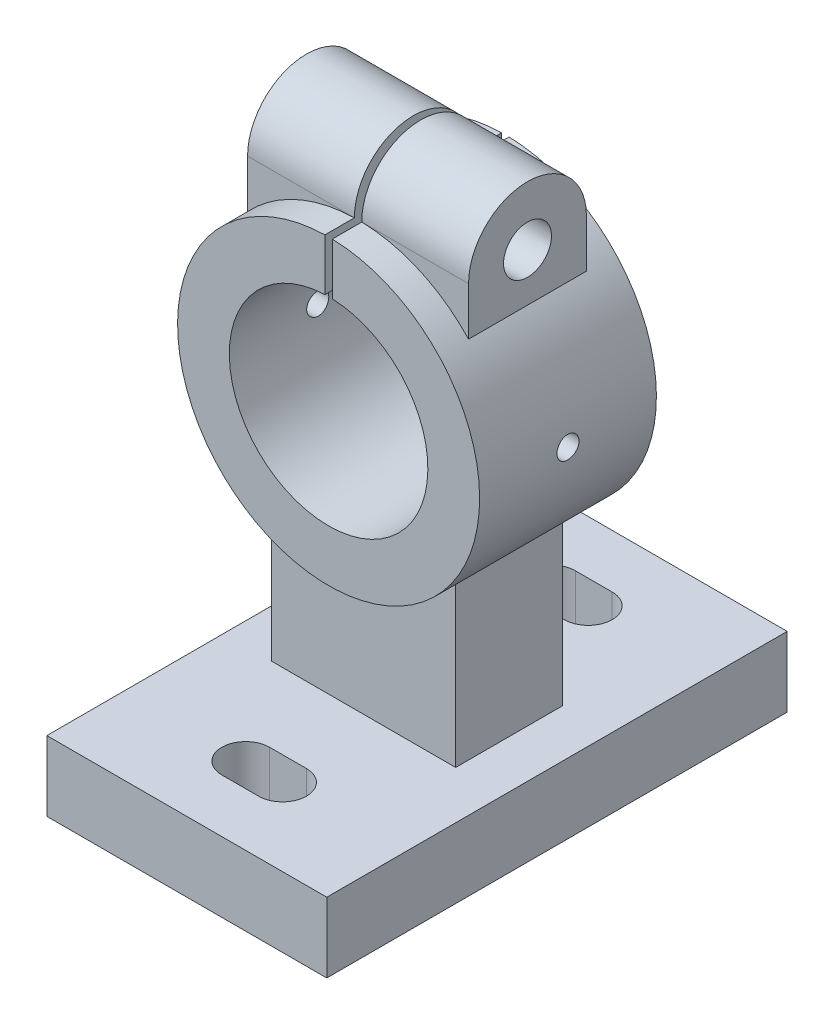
ISO-10303-21;
HEADER;
FILE_DESCRIPTION(('STEP AP214'),'2;1');
FILE_NAME('part.step','',(''),(''),'','','');
FILE_SCHEMA(('AUTOMOTIVE_DESIGN { 1 0 10303 214 1 1 1 1 }'));
ENDSEC;
DATA;
#1=APPLICATION_CONTEXT('core data for automotive mechanical design processes');
#2=APPLICATION_PROTOCOL_DEFINITION('international standard','automotive_design',2000,#1);
#3=PRODUCT_CONTEXT('',#1,'mechanical');
#4=PRODUCT('Part','Part','',(#3));
#5=PRODUCT_RELATED_PRODUCT_CATEGORY('part','',(#4));
#6=PRODUCT_DEFINITION_FORMATION('','',#4);
#7=PRODUCT_DEFINITION_CONTEXT('part definition',#1,'design');
#8=PRODUCT_DEFINITION('design','',#6,#7);
#9=PRODUCT_DEFINITION_SHAPE('','',#8);
#10=(LENGTH_UNIT() NAMED_UNIT(*) SI_UNIT(.MILLI.,.METRE.));
#11=(NAMED_UNIT(*) PLANE_ANGLE_UNIT() SI_UNIT($,.RADIAN.));
#12=(NAMED_UNIT(*) SI_UNIT($,.STERADIAN.) SOLID_ANGLE_UNIT());
#13=UNCERTAINTY_MEASURE_WITH_UNIT(LENGTH_MEASURE(1.E-05),#10,'distance_accuracy_value','');
#14=(GEOMETRIC_REPRESENTATION_CONTEXT(3) GLOBAL_UNCERTAINTY_ASSIGNED_CONTEXT((#13)) GLOBAL_UNIT_ASSIGNED_CONTEXT((#10,
#11,#12)) REPRESENTATION_CONTEXT('',''));
#15=CARTESIAN_POINT('',(0.,0.,0.));
#16=DIRECTION('',(0.,0.,1.));
#17=DIRECTION('',(1.,0.,0.));
#18=AXIS2_PLACEMENT_3D('',#15,#16,#17);
#19=CARTESIAN_POINT('',(30.,41.,0.));
#20=DIRECTION('',(-1.,0.,0.));
#21=DIRECTION('',(0.,0.,1.));
#22=AXIS2_PLACEMENT_3D('',#19,#20,#21);
#23=CYLINDRICAL_SURFACE('',#22,6.5);
#24=CARTESIAN_POINT('',(1.,41.,0.));
#25=DIRECTION('',(1.,0.,0.));
#26=DIRECTION('',(0.,0.,-1.));
#27=AXIS2_PLACEMENT_3D('',#24,#25,#26);
#28=CIRCLE('',#27,6.5);
#29=CARTESIAN_POINT('',(1.,40.9878030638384,-6.49998855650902));
#30=VERTEX_POINT('',#29);
#31=CARTESIAN_POINT('',(1.,40.9878030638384,6.49998855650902));
#32=VERTEX_POINT('',#31);
#33=EDGE_CURVE('E443',#30,#32,#28,.T.);
#34=ORIENTED_EDGE('',*,*,#33,.F.);
#35=CARTESIAN_POINT('',(0.,41.,6.5));
#36=CARTESIAN_POINT('',(0.55066070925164,41.0000000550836,6.49999935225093));
#37=CARTESIAN_POINT('',(1.10131902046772,40.9889048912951,6.50002823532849));
#38=CARTESIAN_POINT('',(2.2017912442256,40.9445404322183,6.49980139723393));
#39=CARTESIAN_POINT('',(2.75160507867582,40.9112691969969,6.49954565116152));
#40=CARTESIAN_POINT('',(3.84984799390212,40.8225721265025,6.49772943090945));
#41=CARTESIAN_POINT('',(4.39827576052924,40.7671300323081,6.49616799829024));
#42=CARTESIAN_POINT('',(5.49241794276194,40.6341855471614,6.49003918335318));
#43=CARTESIAN_POINT('',(6.03813245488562,40.5566839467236,6.48547190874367));
#44=CARTESIAN_POINT('',(7.12749367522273,40.3795025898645,6.47092809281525));
#45=CARTESIAN_POINT('',(7.67112994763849,40.2797597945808,6.46093605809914));
#46=CARTESIAN_POINT('',(8.75377791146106,40.0584154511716,6.4324086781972));
#47=CARTESIAN_POINT('',(9.29278920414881,39.9368120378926,6.41387260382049));
#48=CARTESIAN_POINT('',(10.3643257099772,39.6722190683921,6.36436153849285));
#49=CARTESIAN_POINT('',(10.8968576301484,39.5292541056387,6.33340078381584));
#50=CARTESIAN_POINT('',(11.9545040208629,39.2223507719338,6.25420935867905));
#51=CARTESIAN_POINT('',(12.479620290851,39.0584175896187,6.20598295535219));
#52=CARTESIAN_POINT('',(13.2605021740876,38.7973530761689,6.11610773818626));
#53=CARTESIAN_POINT('',(13.5198173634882,38.7077458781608,6.08320175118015));
#54=CARTESIAN_POINT('',(14.0357508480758,38.5236639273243,6.01062095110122));
#55=CARTESIAN_POINT('',(14.2923693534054,38.4291895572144,5.9709466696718));
#56=CARTESIAN_POINT('',(14.8027203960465,38.2355073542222,5.88377985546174));
#57=CARTESIAN_POINT('',(15.0564504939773,38.1362958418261,5.83628117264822));
#58=CARTESIAN_POINT('',(15.5603133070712,37.9334995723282,5.73232607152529));
#59=CARTESIAN_POINT('',(15.8104460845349,37.8299148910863,5.6758698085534));
#60=CARTESIAN_POINT('',(16.3048202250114,37.6194699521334,5.55308569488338));
#61=CARTESIAN_POINT('',(16.5490898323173,37.5126362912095,5.48682651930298));
#62=CARTESIAN_POINT('',(17.0326899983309,37.2955455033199,5.34265873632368));
#63=CARTESIAN_POINT('',(17.2720199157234,37.1852879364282,5.26474862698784));
#64=CARTESIAN_POINT('',(17.744269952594,36.9622639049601,5.09570782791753));
#65=CARTESIAN_POINT('',(17.9772000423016,36.8495019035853,5.00459927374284));
#66=CARTESIAN_POINT('',(18.4356026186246,36.622314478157,4.80713269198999));
#67=CARTESIAN_POINT('',(18.6610782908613,36.5078897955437,4.7007812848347));
#68=CARTESIAN_POINT('',(19.0597156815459,36.3010659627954,4.49300553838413));
#69=CARTESIAN_POINT('',(19.2345070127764,36.2087214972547,4.39466227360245));
#70=CARTESIAN_POINT('',(19.5768382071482,36.0247851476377,4.18529154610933));
#71=CARTESIAN_POINT('',(19.7443769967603,35.9331933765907,4.07426221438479));
#72=CARTESIAN_POINT('',(20.0701778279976,35.7522390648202,3.83836668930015));
#73=CARTESIAN_POINT('',(20.2284573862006,35.6628725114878,3.71352800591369));
#74=CARTESIAN_POINT('',(20.5337957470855,35.4879442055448,3.44854027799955));
#75=CARTESIAN_POINT('',(20.6808614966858,35.4023801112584,3.30840084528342));
#76=CARTESIAN_POINT('',(20.9898256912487,35.2202430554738,2.98099594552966));
#77=CARTESIAN_POINT('',(21.1485895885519,35.1250063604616,2.78995782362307));
#78=CARTESIAN_POINT('',(21.4392372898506,34.9483623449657,2.38261080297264));
#79=CARTESIAN_POINT('',(21.5711512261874,34.8669395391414,2.16633066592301));
#80=CARTESIAN_POINT('',(21.7805117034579,34.7364641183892,1.74852880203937));
#81=CARTESIAN_POINT('',(21.8634121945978,34.6842583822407,1.5507907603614));
#82=CARTESIAN_POINT('',(21.9659633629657,34.6193309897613,1.24419818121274));
#83=CARTESIAN_POINT('',(21.9965177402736,34.5999161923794,1.14031469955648));
#84=CARTESIAN_POINT('',(22.0498313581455,34.5659650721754,0.9298051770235));
#85=CARTESIAN_POINT('',(22.0725940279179,34.5514266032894,0.823180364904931));
#86=CARTESIAN_POINT('',(22.1099946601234,34.5275054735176,0.607205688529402));
#87=CARTESIAN_POINT('',(22.1245779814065,34.5181574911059,0.497842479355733));
#88=CARTESIAN_POINT('',(22.1450729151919,34.505012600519,0.277970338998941));
#89=CARTESIAN_POINT('',(22.1509845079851,34.5012157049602,0.167461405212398));
#90=CARTESIAN_POINT('',(22.1539963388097,34.4992819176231,-0.0537163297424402));
#91=CARTESIAN_POINT('',(22.1510978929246,34.5011441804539,-0.164385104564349));
#92=CARTESIAN_POINT('',(22.1365740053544,34.5104643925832,-0.38487634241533));
#93=CARTESIAN_POINT('',(22.1249490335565,34.5179220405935,-0.494698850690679));
#94=CARTESIAN_POINT('',(22.0804946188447,34.5463889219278,-0.799696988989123));
#95=CARTESIAN_POINT('',(22.0381459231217,34.5734638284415,-0.993017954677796));
#96=CARTESIAN_POINT('',(21.9286840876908,34.6429927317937,-1.36939971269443));
#97=CARTESIAN_POINT('',(21.8615626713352,34.6854518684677,-1.55245705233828));
#98=CARTESIAN_POINT('',(21.6762335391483,34.8016799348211,-1.97359408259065));
#99=CARTESIAN_POINT('',(21.5483061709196,34.8812108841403,-2.2058037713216));
#100=CARTESIAN_POINT('',(21.2612348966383,35.056927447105,-2.6430614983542));
#101=CARTESIAN_POINT('',(21.1020246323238,35.1531484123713,-2.84805021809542));
#102=CARTESIAN_POINT('',(20.8014456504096,35.3316114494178,-3.18535489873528));
#103=CARTESIAN_POINT('',(20.6649650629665,35.4116663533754,-3.32330515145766));
#104=CARTESIAN_POINT('',(20.3810979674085,35.5758023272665,-3.58496192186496));
#105=CARTESIAN_POINT('',(20.2337055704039,35.6598855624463,-3.70866065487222));
#106=CARTESIAN_POINT('',(19.9299646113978,35.8305305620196,-3.94304809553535));
#107=CARTESIAN_POINT('',(19.7736040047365,35.9170955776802,-4.05371866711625));
#108=CARTESIAN_POINT('',(19.4536474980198,36.0913951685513,-4.26311623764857));
#109=CARTESIAN_POINT('',(19.290048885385,36.1791301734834,-4.36183870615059));
#110=CARTESIAN_POINT('',(18.9731111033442,36.3462510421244,-4.53938337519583));
#111=CARTESIAN_POINT('',(18.8203198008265,36.4256197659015,-4.61920714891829));
#112=CARTESIAN_POINT('',(18.5106021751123,36.5839841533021,-4.77082896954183));
#113=CARTESIAN_POINT('',(18.3536751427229,36.6629797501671,-4.8426256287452));
#114=CARTESIAN_POINT('',(17.8774214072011,36.8988230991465,-5.04715589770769));
#115=CARTESIAN_POINT('',(17.5527627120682,37.0544529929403,-5.16895305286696));
#116=CARTESIAN_POINT('',(16.8922980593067,37.360181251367,-5.38861419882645));
#117=CARTESIAN_POINT('',(16.5564719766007,37.5102684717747,-5.48643198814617));
#118=CARTESIAN_POINT('',(15.8766212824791,37.8030401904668,-5.66202794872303));
#119=CARTESIAN_POINT('',(15.5325986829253,37.9457264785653,-5.73981098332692));
#120=CARTESIAN_POINT('',(14.822397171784,38.2289051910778,-5.88194152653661));
#121=CARTESIAN_POINT('',(14.4559158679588,38.3690133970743,-5.94553161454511));
#122=CARTESIAN_POINT('',(13.7170342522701,38.6393295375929,-6.05794120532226));
#123=CARTESIAN_POINT('',(13.3446326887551,38.7695353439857,-6.10675753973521));
#124=CARTESIAN_POINT('',(12.5946794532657,39.0196161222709,-6.1923787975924));
#125=CARTESIAN_POINT('',(12.2171236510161,39.1394821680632,-6.22917341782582));
#126=CARTESIAN_POINT('',(11.4579797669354,39.3684122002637,-6.29301481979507));
#127=CARTESIAN_POINT('',(11.0763919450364,39.4774768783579,-6.32006222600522));
#128=CARTESIAN_POINT('',(10.3088458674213,39.6848348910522,-6.3664473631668));
#129=CARTESIAN_POINT('',(9.92287922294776,39.7831013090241,-6.3857661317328));
#130=CARTESIAN_POINT('',(9.14800929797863,39.9683952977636,-6.4183048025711));
#131=CARTESIAN_POINT('',(8.75910600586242,40.055422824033,-6.43152468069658));
#132=CARTESIAN_POINT('',(7.97892324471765,40.2180994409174,-6.45332202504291));
#133=CARTESIAN_POINT('',(7.58764452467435,40.2937519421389,-6.46190088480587));
#134=CARTESIAN_POINT('',(6.80298630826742,40.4336272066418,-6.47565824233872));
#135=CARTESIAN_POINT('',(6.40960674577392,40.4978496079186,-6.48083663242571));
#136=CARTESIAN_POINT('',(5.44587656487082,40.6407902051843,-6.490623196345));
#137=CARTESIAN_POINT('',(4.8745760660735,40.7132652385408,-6.493955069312));
#138=CARTESIAN_POINT('',(3.72939908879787,40.8340928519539,-6.498162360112));
#139=CARTESIAN_POINT('',(3.15552244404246,40.8824438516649,-6.49903761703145));
#140=CARTESIAN_POINT('',(2.00600083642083,40.9549478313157,-6.49994536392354));
#141=CARTESIAN_POINT('',(1.43035524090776,40.9790908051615,-6.49997750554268));
#142=CARTESIAN_POINT('',(0.278574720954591,41.0030996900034,-6.50001029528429));
#143=CARTESIAN_POINT('',(-0.297560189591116,41.0029662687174,-6.50001094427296));
#144=CARTESIAN_POINT('',(-1.4482804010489,40.9784465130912,-6.49997576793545));
#145=CARTESIAN_POINT('',(-2.02286662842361,40.9541036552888,-6.49994000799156));
#146=CARTESIAN_POINT('',(-3.17052935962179,40.8812715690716,-6.4990175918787));
#147=CARTESIAN_POINT('',(-3.7436058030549,40.8327813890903,-6.49813090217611));
#148=CARTESIAN_POINT('',(-4.88692704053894,40.7117702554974,-6.49388844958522));
#149=CARTESIAN_POINT('',(-5.45717307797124,40.6392610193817,-6.4905338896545));
#150=CARTESIAN_POINT('',(-6.59400526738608,40.4703506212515,-6.47893828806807));
#151=CARTESIAN_POINT('',(-7.160591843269,40.3739522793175,-6.47069782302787));
#152=CARTESIAN_POINT('',(-8.2747552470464,40.1602036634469,-6.44639583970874));
#153=CARTESIAN_POINT('',(-8.82244989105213,40.0434464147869,-6.43053786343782));
#154=CARTESIAN_POINT('',(-9.912145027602,39.7877188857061,-6.38726834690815));
#155=CARTESIAN_POINT('',(-10.4541459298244,39.6487502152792,-6.35985764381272));
#156=CARTESIAN_POINT('',(-11.5313805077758,39.3489499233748,-6.28870731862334));
#157=CARTESIAN_POINT('',(-12.0666105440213,39.188107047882,-6.24495927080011));
#158=CARTESIAN_POINT('',(-12.8625748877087,38.9311180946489,-6.1626103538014));
#159=CARTESIAN_POINT('',(-13.1267398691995,38.8428379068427,-6.13237434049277));
#160=CARTESIAN_POINT('',(-13.6524777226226,38.6611846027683,-6.06541998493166));
#161=CARTESIAN_POINT('',(-13.9140506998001,38.5678116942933,-6.02870190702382));
#162=CARTESIAN_POINT('',(-14.5598148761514,38.3298918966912,-5.92826780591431));
#163=CARTESIAN_POINT('',(-14.9422502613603,38.1823983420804,-5.86007498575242));
#164=CARTESIAN_POINT('',(-15.6991005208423,37.8774966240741,-5.70345182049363));
#165=CARTESIAN_POINT('',(-16.0735133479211,37.7200859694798,-5.61501637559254));
#166=CARTESIAN_POINT('',(-16.8107523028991,37.3973226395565,-5.41357989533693));
#167=CARTESIAN_POINT('',(-17.1736138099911,37.2319990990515,-5.30066427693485));
#168=CARTESIAN_POINT('',(-17.707409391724,36.9795415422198,-5.10852506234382));
#169=CARTESIAN_POINT('',(-17.8835487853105,36.8946655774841,-5.04070429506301));
#170=CARTESIAN_POINT('',(-18.2317851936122,36.7238283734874,-4.89661709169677));
#171=CARTESIAN_POINT('',(-18.4038829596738,36.6378673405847,-4.82035224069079));
#172=CARTESIAN_POINT('',(-18.7284198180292,36.4729551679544,-4.66556535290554));
#173=CARTESIAN_POINT('',(-18.8812575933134,36.3940517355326,-4.58783040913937));
#174=CARTESIAN_POINT('',(-19.1822981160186,36.236284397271,-4.42379536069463));
#175=CARTESIAN_POINT('',(-19.3305011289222,36.1574204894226,-4.33749574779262));
#176=CARTESIAN_POINT('',(-19.6217295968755,36.0002105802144,-4.1553114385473));
#177=CARTESIAN_POINT('',(-19.7647436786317,35.9218659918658,-4.05940723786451));
#178=CARTESIAN_POINT('',(-20.0441936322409,35.7666861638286,-3.85728672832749));
#179=CARTESIAN_POINT('',(-20.1806295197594,35.6898509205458,-3.75107044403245));
#180=CARTESIAN_POINT('',(-20.4476212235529,35.5375682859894,-3.52570819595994));
#181=CARTESIAN_POINT('',(-20.5780534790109,35.4621607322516,-3.4063876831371));
#182=CARTESIAN_POINT('',(-20.8289866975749,35.3153570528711,-3.15531125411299));
#183=CARTESIAN_POINT('',(-20.9494851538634,35.2439619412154,-3.0235522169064));
#184=CARTESIAN_POINT('',(-21.1778360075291,35.1072200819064,-2.74749970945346));
#185=CARTESIAN_POINT('',(-21.2857363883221,35.0418505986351,-2.60325770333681));
#186=CARTESIAN_POINT('',(-21.4866357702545,34.9190254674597,-2.30179019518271));
#187=CARTESIAN_POINT('',(-21.5796496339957,34.8615619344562,-2.14457788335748));
#188=CARTESIAN_POINT('',(-21.7589896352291,34.7499495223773,-1.7957056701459));
#189=CARTESIAN_POINT('',(-21.8428009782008,34.6972461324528,-1.60224053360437));
#190=CARTESIAN_POINT('',(-21.9476726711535,34.6309308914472,-1.30211704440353));
#191=CARTESIAN_POINT('',(-21.9791597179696,34.6109465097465,-1.20040113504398));
#192=CARTESIAN_POINT('',(-22.0346740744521,34.5756304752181,-0.994180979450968));
#193=CARTESIAN_POINT('',(-22.0587047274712,34.5602967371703,-0.889678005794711));
#194=CARTESIAN_POINT('',(-22.0989882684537,34.5345521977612,-0.677828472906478));
#195=CARTESIAN_POINT('',(-22.1151866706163,34.5241758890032,-0.570467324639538));
#196=CARTESIAN_POINT('',(-22.1392182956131,34.5087701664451,-0.354471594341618));
#197=CARTESIAN_POINT('',(-22.1470550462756,34.5037384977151,-0.245837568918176));
#198=CARTESIAN_POINT('',(-22.1542028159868,34.499149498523,-0.0281689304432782));
#199=CARTESIAN_POINT('',(-22.1535135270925,34.4995923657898,0.0808656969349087));
#200=CARTESIAN_POINT('',(-22.143624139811,34.5059407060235,0.298382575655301));
#201=CARTESIAN_POINT('',(-22.1344244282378,34.5118459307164,0.406864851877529));
#202=CARTESIAN_POINT('',(-22.1088555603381,34.5282306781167,0.613169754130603));
#203=CARTESIAN_POINT('',(-22.0931652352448,34.538276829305,0.711112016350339));
#204=CARTESIAN_POINT('',(-22.055109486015,34.5625903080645,0.905171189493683));
#205=CARTESIAN_POINT('',(-22.0327419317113,34.5768589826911,1.00128750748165));
#206=CARTESIAN_POINT('',(-21.9561488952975,34.6255863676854,1.28602016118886));
#207=CARTESIAN_POINT('',(-21.8924174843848,34.6659765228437,1.47114078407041));
#208=CARTESIAN_POINT('',(-21.71672128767,34.7764018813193,1.89196133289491));
#209=CARTESIAN_POINT('',(-21.5956693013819,34.8518696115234,2.12238957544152));
#210=CARTESIAN_POINT('',(-21.3225239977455,35.0196459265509,2.55733964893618));
#211=CARTESIAN_POINT('',(-21.1703671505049,35.11198893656,2.76180704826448));
#212=CARTESIAN_POINT('',(-20.8834914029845,35.2831468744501,3.09737226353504));
#213=CARTESIAN_POINT('',(-20.7538092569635,35.3596355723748,3.23408866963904));
#214=CARTESIAN_POINT('',(-20.4836951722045,35.5167937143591,3.49392549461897));
#215=CARTESIAN_POINT('',(-20.34325762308,35.5974653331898,3.61703873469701));
#216=CARTESIAN_POINT('',(-20.0535295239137,35.7614835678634,3.85076091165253));
#217=CARTESIAN_POINT('',(-19.904227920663,35.8448334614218,3.96135371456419));
#218=CARTESIAN_POINT('',(-19.5984454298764,36.0129343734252,4.17099691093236));
#219=CARTESIAN_POINT('',(-19.4419618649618,36.0976859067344,4.27004295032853));
#220=CARTESIAN_POINT('',(-18.9978136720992,36.3343756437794,4.53135178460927));
#221=CARTESIAN_POINT('',(-18.7036499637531,36.4868011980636,4.68216562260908));
#222=CARTESIAN_POINT('',(-18.1014407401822,36.7892883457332,4.95595589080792));
#223=CARTESIAN_POINT('',(-17.7933840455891,36.9393478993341,5.07890940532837));
#224=CARTESIAN_POINT('',(-17.1661118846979,37.2349983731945,5.30180077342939));
#225=CARTESIAN_POINT('',(-16.8468724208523,37.3805782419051,5.40168513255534));
#226=CARTESIAN_POINT('',(-16.2003089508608,37.6652997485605,5.58194755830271));
#227=CARTESIAN_POINT('',(-15.8729869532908,37.8044429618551,5.66233041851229));
#228=CARTESIAN_POINT('',(-15.1982900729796,38.080838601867,5.80982096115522));
#229=CARTESIAN_POINT('',(-14.8506423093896,38.2177814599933,5.87625200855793));
#230=CARTESIAN_POINT('',(-14.149524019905,38.4828727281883,5.99459185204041));
#231=CARTESIAN_POINT('',(-13.7960522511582,38.6110192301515,6.0464975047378));
#232=CARTESIAN_POINT('',(-13.0840236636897,38.8580811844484,6.13836806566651));
#233=CARTESIAN_POINT('',(-12.7254625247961,38.9769881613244,6.17832210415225));
#234=CARTESIAN_POINT('',(-12.0043561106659,39.205081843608,6.24839952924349));
#235=CARTESIAN_POINT('',(-11.6418111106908,39.3142692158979,6.27852359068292));
#236=CARTESIAN_POINT('',(-10.9130223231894,39.5227746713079,6.3308264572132));
#237=CARTESIAN_POINT('',(-10.5467758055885,39.6220847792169,6.35299887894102));
#238=CARTESIAN_POINT('',(-9.81135696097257,39.8105686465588,6.39096955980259));
#239=CARTESIAN_POINT('',(-9.44218457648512,39.8997422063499,6.40676769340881));
#240=CARTESIAN_POINT('',(-8.70151071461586,40.0677907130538,6.43336772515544));
#241=CARTESIAN_POINT('',(-8.33001041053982,40.1466704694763,6.44417196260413));
#242=CARTESIAN_POINT('',(-7.58489272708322,40.2940894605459,6.46198046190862));
#243=CARTESIAN_POINT('',(-7.21127540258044,40.3626289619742,6.46898482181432));
#244=CARTESIAN_POINT('',(-6.27222507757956,40.521438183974,6.48307184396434));
#245=CARTESIAN_POINT('',(-5.70563447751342,40.605093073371,6.4883916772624));
#246=CARTESIAN_POINT('',(-4.56946328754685,40.7485937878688,6.49553220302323));
#247=CARTESIAN_POINT('',(-3.99988279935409,40.8084404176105,6.49735301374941));
#248=CARTESIAN_POINT('',(-2.85911112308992,40.9041914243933,6.49947042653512));
#249=CARTESIAN_POINT('',(-2.28792134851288,40.9401126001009,6.49976809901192));
#250=CARTESIAN_POINT('',(-1.14448691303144,40.9880179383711,6.50003323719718));
#251=CARTESIAN_POINT('',(-0.572242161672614,40.9999999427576,6.5000006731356));
#252=CARTESIAN_POINT('',(0.,41.,6.5));
#253=B_SPLINE_CURVE_WITH_KNOTS('',3,(#35,#36,#37,#38,#39,#40,#41,#42,#43,#44,#45,#46,#47,#48,
#49,#50,#51,#52,#53,#54,#55,#56,#57,#58,#59,#60,#61,#62,#63,#64,#65,#66,#67,#68,#69,#70,#71,#72,
#73,#74,#75,#76,#77,#78,#79,#80,#81,#82,#83,#84,#85,#86,#87,#88,#89,#90,#91,#92,#93,#94,#95,#96,
#97,#98,#99,#100,#101,#102,#103,#104,#105,#106,#107,#108,#109,#110,#111,#112,#113,#114,#115,
#116,#117,#118,#119,#120,#121,#122,#123,#124,#125,#126,#127,#128,#129,#130,#131,#132,#133,#134,
#135,#136,#137,#138,#139,#140,#141,#142,#143,#144,#145,#146,#147,#148,#149,#150,#151,#152,#153,
#154,#155,#156,#157,#158,#159,#160,#161,#162,#163,#164,#165,#166,#167,#168,#169,#170,#171,#172,
#173,#174,#175,#176,#177,#178,#179,#180,#181,#182,#183,#184,#185,#186,#187,#188,#189,#190,#191,
#192,#193,#194,#195,#196,#197,#198,#199,#200,#201,#202,#203,#204,#205,#206,#207,#208,#209,#210,
#211,#212,#213,#214,#215,#216,#217,#218,#219,#220,#221,#222,#223,#224,#225,#226,#227,#228,#229,
#230,#231,#232,#233,#234,#235,#236,#237,#238,#239,#240,#241,#242,#243,#244,#245,#246,#247,#248,
#249,#250,#251,#252),.UNSPECIFIED.,.T.,.F.,(4,2,2,2,2,2,2,2,2,2,2,2,2,2,2,2,2,2,2,2,2,2,2,2,2,2,
2,2,2,2,2,2,2,2,2,2,2,2,2,2,2,2,2,2,2,2,2,2,2,2,2,2,2,2,2,2,2,2,2,2,2,2,2,2,2,2,2,2,2,2,2,2,2,2,
2,2,2,2,2,2,2,2,2,2,2,2,2,2,2,2,2,2,2,2,2,2,2,2,2,2,2,2,2,2,2,2,2,2,4),(0.,1.65186627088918,
3.30387706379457,4.9571015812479,6.61026686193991,8.26817869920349,9.9262320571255,
11.5823910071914,13.2381409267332,14.0670096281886,14.8958132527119,15.7252714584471,
16.5547152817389,17.3786017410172,18.2025945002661,19.0252209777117,19.8474912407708,
20.5094673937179,21.1715412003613,21.8323190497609,22.4926841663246,23.288348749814,
24.0831154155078,24.7422037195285,25.0718793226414,25.4014096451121,25.7331159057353,
26.0648229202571,26.3964803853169,26.7281199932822,27.324522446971,27.9211243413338,
28.7468609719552,29.5743684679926,30.2032799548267,30.8325333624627,31.462652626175,
32.0930100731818,32.6621134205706,33.2313150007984,34.3702462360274,35.5113549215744,
36.6521863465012,37.8440932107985,39.0362555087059,40.2294368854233,41.4225418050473,
42.6185563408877,43.8145756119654,45.0102355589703,46.2059333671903,47.9330476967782,
49.6602751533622,51.3882162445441,53.1161098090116,54.8409059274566,56.5657700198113,
58.2897938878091,60.0136143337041,61.6937395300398,63.373742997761,65.0546141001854,
65.8949872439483,66.7353261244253,67.9812791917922,69.227546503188,70.4695333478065,
71.0902143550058,71.7107790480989,72.2768185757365,72.8428256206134,73.410006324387,
73.977185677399,74.5531361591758,75.1292315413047,75.7030557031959,76.2763033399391,
76.925427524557,77.2501141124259,77.5746549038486,77.901422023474,78.2280512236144,
78.5546922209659,78.8813183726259,79.1800706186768,79.4789182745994,80.0762518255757,
80.8848794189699,81.6951753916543,82.3044745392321,82.9140937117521,83.5244897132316,
84.1351151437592,85.2253425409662,86.3164634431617,87.410089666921,88.5034467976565,
89.6414789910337,90.7797572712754,91.9190676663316,93.0582998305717,94.1984445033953,
95.3386116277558,96.4782441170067,97.6178471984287,99.3355638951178,101.053222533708,
102.769673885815,104.486279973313),.UNSPECIFIED.);
#254=EDGE_CURVE('E312',#32,#30,#253,.T.);
#255=ORIENTED_EDGE('',*,*,#254,.F.);
#256=EDGE_LOOP('',(#34,#255));
#257=FACE_BOUND('',#256,.T.);
#258=CARTESIAN_POINT('',(30.,41.,0.));
#259=DIRECTION('',(1.,0.,0.));
#260=DIRECTION('',(0.,0.,-1.));
#261=AXIS2_PLACEMENT_3D('',#258,#259,#260);
#262=CIRCLE('',#261,6.5);
#263=CARTESIAN_POINT('',(30.,41.,-6.5));
#264=VERTEX_POINT('',#263);
#265=EDGE_CURVE('E459',#264,#264,#262,.T.);
#266=ORIENTED_EDGE('',*,*,#265,.T.);
#267=EDGE_LOOP('',(#266));
#268=FACE_BOUND('',#267,.T.);
#269=ADVANCED_FACE('F33',(#257,#268),#23,.F.);
#270=CARTESIAN_POINT('',(30.,41.,0.));
#271=DIRECTION('',(-1.,0.,0.));
#272=DIRECTION('',(0.,0.,1.));
#273=AXIS2_PLACEMENT_3D('',#270,#271,#272);
#274=CYLINDRICAL_SURFACE('',#273,16.);
#275=CARTESIAN_POINT('',(1.,41.,0.));
#276=DIRECTION('',(1.,0.,0.));
#277=DIRECTION('',(0.,0.,-1.));
#278=AXIS2_PLACEMENT_3D('',#275,#276,#277);
#279=CIRCLE('',#278,16.);
#280=CARTESIAN_POINT('',(1.,41.,-16.));
#281=VERTEX_POINT('',#280);
#282=CARTESIAN_POINT('',(1.,41.,16.));
#283=VERTEX_POINT('',#282);
#284=EDGE_CURVE('E447',#281,#283,#279,.T.);
#285=ORIENTED_EDGE('',*,*,#284,.T.);
#286=DIRECTION('',(-1.,0.,0.));
#287=VECTOR('',#286,1.);
#288=CARTESIAN_POINT('',(30.,41.,16.));
#289=LINE('',#288,#287);
#290=CARTESIAN_POINT('',(30.,41.,16.));
#291=VERTEX_POINT('',#290);
#292=EDGE_CURVE('E486',#291,#283,#289,.T.);
#293=ORIENTED_EDGE('',*,*,#292,.F.);
#294=CARTESIAN_POINT('',(30.,41.,0.));
#295=DIRECTION('',(1.,0.,0.));
#296=DIRECTION('',(0.,0.,1.));
#297=AXIS2_PLACEMENT_3D('',#294,#295,#296);
#298=CIRCLE('',#297,16.);
#299=CARTESIAN_POINT('',(30.,41.,-16.));
#300=VERTEX_POINT('',#299);
#301=EDGE_CURVE('E465',#300,#291,#298,.T.);
#302=ORIENTED_EDGE('',*,*,#301,.F.);
#303=DIRECTION('',(-1.,0.,0.));
#304=VECTOR('',#303,1.);
#305=CARTESIAN_POINT('',(30.,41.,-16.));
#306=LINE('',#305,#304);
#307=EDGE_CURVE('E482',#300,#281,#306,.T.);
#308=ORIENTED_EDGE('',*,*,#307,.T.);
#309=EDGE_LOOP('',(#285,#293,#302,#308));
#310=FACE_BOUND('',#309,.T.);
#311=ADVANCED_FACE('F352',(#310),#274,.T.);
#312=CARTESIAN_POINT('',(0.,0.,14.5));
#313=DIRECTION('',(0.,0.,-1.));
#314=DIRECTION('',(-1.,0.,0.));
#315=AXIS2_PLACEMENT_3D('',#312,#313,#314);
#316=CYLINDRICAL_SURFACE('',#315,41.);
#317=ORIENTED_EDGE('',*,*,#254,.T.);
#318=DIRECTION('',(0.,0.,-1.));
#319=VECTOR('',#318,1.);
#320=CARTESIAN_POINT('',(1.,40.9878030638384,14.5));
#321=LINE('',#320,#319);
#322=EDGE_CURVE('E11',#30,#32,#321,.F.);
#323=ORIENTED_EDGE('',*,*,#322,.T.);
#324=EDGE_LOOP('',(#317,#323));
#325=FACE_BOUND('',#324,.T.);
#326=ADVANCED_FACE('F616',(#325),#316,.T.);
#327=CARTESIAN_POINT('',(-41.,0.,-3.));
#328=CARTESIAN_POINT('',(-40.9999985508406,0.168269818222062,-2.99999262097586));
#329=CARTESIAN_POINT('',(-40.9989530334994,0.336655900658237,-2.98579503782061));
#330=CARTESIAN_POINT('',(-40.9948827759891,0.668774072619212,-2.92936435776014));
#331=CARTESIAN_POINT('',(-40.9918557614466,0.832500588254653,-2.88709904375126));
#332=CARTESIAN_POINT('',(-40.9841647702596,1.15044111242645,-2.77575732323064));
#333=CARTESIAN_POINT('',(-40.9795016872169,1.3046602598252,-2.70669555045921));
#334=CARTESIAN_POINT('',(-40.9690622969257,1.59927860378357,-2.5437462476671));
#335=CARTESIAN_POINT('',(-40.9632862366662,1.73968085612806,-2.44986422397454));
#336=CARTESIAN_POINT('',(-40.9512567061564,2.00299928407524,-2.23973548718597));
#337=CARTESIAN_POINT('',(-40.9450024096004,2.12588409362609,-2.12344951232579));
#338=CARTESIAN_POINT('',(-40.9327282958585,2.35041064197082,-1.87189595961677));
#339=CARTESIAN_POINT('',(-40.9267084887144,2.45205147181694,-1.73662756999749));
#340=CARTESIAN_POINT('',(-40.9155756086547,2.63130704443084,-1.45076418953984));
#341=CARTESIAN_POINT('',(-40.9104635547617,2.7088948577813,-1.30015226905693));
#342=CARTESIAN_POINT('',(-40.9017337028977,2.8376698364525,-0.987995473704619));
#343=CARTESIAN_POINT('',(-40.8981158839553,2.88885737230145,-0.826450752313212));
#344=CARTESIAN_POINT('',(-40.8927905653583,2.9632894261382,-0.497323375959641));
#345=CARTESIAN_POINT('',(-40.8910796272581,2.98658424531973,-0.329752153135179));
#346=CARTESIAN_POINT('',(-40.8897507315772,3.00472494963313,0.00693001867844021));
#347=CARTESIAN_POINT('',(-40.8901327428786,2.99957125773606,0.176040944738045));
#348=CARTESIAN_POINT('',(-40.8929434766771,2.96100288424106,0.510658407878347));
#349=CARTESIAN_POINT('',(-40.8953682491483,2.92764274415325,0.676171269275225));
#350=CARTESIAN_POINT('',(-40.9019850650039,2.83369311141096,0.999241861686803));
#351=CARTESIAN_POINT('',(-40.9061771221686,2.77310340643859,1.15679953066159));
#352=CARTESIAN_POINT('',(-40.9158606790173,2.62635304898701,1.45966182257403));
#353=CARTESIAN_POINT('',(-40.9213534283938,2.5401677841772,1.60495447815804));
#354=CARTESIAN_POINT('',(-40.9330182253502,2.34469057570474,1.8790315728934));
#355=CARTESIAN_POINT('',(-40.9391902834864,2.23539827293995,2.00781575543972));
#356=CARTESIAN_POINT('',(-40.951535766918,1.99650281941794,2.24553742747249));
#357=CARTESIAN_POINT('',(-40.9577091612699,1.86685249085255,2.35442751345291));
#358=CARTESIAN_POINT('',(-40.9693477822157,1.59108628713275,2.54890394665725));
#359=CARTESIAN_POINT('',(-40.9748130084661,1.44497040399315,2.63449028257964));
#360=CARTESIAN_POINT('',(-40.9844201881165,1.14039104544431,2.77992623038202));
#361=CARTESIAN_POINT('',(-40.988562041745,0.981926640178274,2.83977390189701));
#362=CARTESIAN_POINT('',(-40.9950545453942,0.657161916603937,2.9320012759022));
#363=CARTESIAN_POINT('',(-40.9974052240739,0.490861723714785,2.96438141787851));
#364=CARTESIAN_POINT('',(-41.0000468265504,0.155557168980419,3.00069551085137));
#365=CARTESIAN_POINT('',(-41.0003424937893,-0.0134400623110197,3.00469497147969));
#366=CARTESIAN_POINT('',(-40.998853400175,-0.349702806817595,2.98430555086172));
#367=CARTESIAN_POINT('',(-40.9970686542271,-0.516968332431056,2.9599168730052));
#368=CARTESIAN_POINT('',(-40.9916226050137,-0.844834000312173,2.88349774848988));
#369=CARTESIAN_POINT('',(-40.987963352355,-1.00544121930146,2.83149750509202));
#370=CARTESIAN_POINT('',(-40.9791796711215,-1.31565002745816,2.70136210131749));
#371=CARTESIAN_POINT('',(-40.9740552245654,-1.46525148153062,2.62322662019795));
#372=CARTESIAN_POINT('',(-40.9629044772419,-1.74950123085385,2.44287297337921));
#373=CARTESIAN_POINT('',(-40.9568765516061,-1.88412180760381,2.34061122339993));
#374=CARTESIAN_POINT('',(-40.9446021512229,-2.13430901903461,2.11497108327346));
#375=CARTESIAN_POINT('',(-40.938355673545,-2.24987539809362,1.99159240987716));
#376=CARTESIAN_POINT('',(-40.9263342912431,-2.45889696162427,1.72693726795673));
#377=CARTESIAN_POINT('',(-40.920560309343,-2.55230952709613,1.58562709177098));
#378=CARTESIAN_POINT('',(-40.9101499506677,-2.71407997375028,1.28928884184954));
#379=CARTESIAN_POINT('',(-40.9055135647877,-2.78243805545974,1.13426087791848));
#380=CARTESIAN_POINT('',(-40.897907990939,-2.8920858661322,0.815041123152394));
#381=CARTESIAN_POINT('',(-40.8949371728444,-2.93340206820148,0.650858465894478));
#382=CARTESIAN_POINT('',(-40.8909932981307,-2.98787963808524,0.317863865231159));
#383=CARTESIAN_POINT('',(-40.8900202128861,-3.00104140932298,0.149051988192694));
#384=CARTESIAN_POINT('',(-40.8901822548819,-2.99883228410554,-0.187985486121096));
#385=CARTESIAN_POINT('',(-40.8913124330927,-2.98352836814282,-0.356211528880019));
#386=CARTESIAN_POINT('',(-40.8955431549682,-2.92496154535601,-0.687697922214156));
#387=CARTESIAN_POINT('',(-40.8986437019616,-2.88169859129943,-0.850958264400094));
#388=CARTESIAN_POINT('',(-40.90646452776,-2.76845782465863,-1.16788607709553));
#389=CARTESIAN_POINT('',(-40.9111847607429,-2.69848076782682,-1.32155381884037));
#390=CARTESIAN_POINT('',(-40.9217130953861,-2.53380635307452,-1.61496988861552));
#391=CARTESIAN_POINT('',(-40.9275211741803,-2.43910951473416,-1.75471850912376));
#392=CARTESIAN_POINT('',(-40.9395868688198,-2.22743316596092,-2.01667109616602));
#393=CARTESIAN_POINT('',(-40.9458454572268,-2.11040448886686,-2.13883528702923));
#394=CARTESIAN_POINT('',(-40.9580982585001,-1.8574669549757,-2.36183090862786));
#395=CARTESIAN_POINT('',(-40.9640924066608,-1.72155351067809,-2.46265714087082));
#396=CARTESIAN_POINT('',(-40.9751492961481,-1.43449927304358,-2.64021763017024));
#397=CARTESIAN_POINT('',(-40.9802105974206,-1.28333548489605,-2.71691476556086));
#398=CARTESIAN_POINT('',(-40.9888135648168,-0.970345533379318,-2.84374364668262));
#399=CARTESIAN_POINT('',(-40.992356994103,-0.808531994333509,-2.89390623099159));
#400=CARTESIAN_POINT('',(-40.9966053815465,-0.538120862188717,-2.95332904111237));
#401=CARTESIAN_POINT('',(-40.9978726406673,-0.431267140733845,-2.9708077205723));
#402=CARTESIAN_POINT('',(-40.999570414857,-0.216291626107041,-2.99414556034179));
#403=CARTESIAN_POINT('',(-41.0000009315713,-0.108169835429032,-3.00000474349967));
#404=CARTESIAN_POINT('',(-41.,0.,-3.));
#405=B_SPLINE_CURVE_WITH_KNOTS('',3,(#327,#328,#329,#330,#331,#332,#333,#334,#335,#336,#337,
#338,#339,#340,#341,#342,#343,#344,#345,#346,#347,#348,#349,#350,#351,#352,#353,#354,#355,#356,
#357,#358,#359,#360,#361,#362,#363,#364,#365,#366,#367,#368,#369,#370,#371,#372,#373,#374,#375,
#376,#377,#378,#379,#380,#381,#382,#383,#384,#385,#386,#387,#388,#389,#390,#391,#392,#393,#394,
#395,#396,#397,#398,#399,#400,#401,#402,#403,#404),.UNSPECIFIED.,.T.,.F.,(4,2,2,2,2,2,2,2,2,2,2,
2,2,2,2,2,2,2,2,2,2,2,2,2,2,2,2,2,2,2,2,2,2,2,2,2,2,2,4),(0.,0.504414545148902,1.00940907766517,
1.5141282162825,2.01873547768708,2.5242352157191,3.02975657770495,3.53584188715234,
4.04192009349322,4.54708426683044,5.05224092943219,5.55642302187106,6.06060904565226,
6.56528146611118,7.06996173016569,7.57582928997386,8.08169709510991,8.58760302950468,
9.0935008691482,9.59823059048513,10.1029566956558,10.6071318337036,11.1113131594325,
11.6164123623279,12.121518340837,12.6275882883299,13.1336541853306,13.6392239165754,
14.1447864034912,14.6491607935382,15.1535360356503,15.6578970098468,16.1622473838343,
16.6677212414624,17.1733181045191,17.6796890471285,18.1854701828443,18.5097264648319,
18.8339821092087),.UNSPECIFIED.);
#406=CARTESIAN_POINT('',(-41.,0.,-3.));
#407=VERTEX_POINT('',#406);
#408=EDGE_CURVE('E250',#407,#407,#405,.T.);
#409=ORIENTED_EDGE('',*,*,#408,.T.);
#410=EDGE_LOOP('',(#409));
#411=FACE_BOUND('',#410,.T.);
#412=CARTESIAN_POINT('',(41.,0.,-3.));
#413=CARTESIAN_POINT('',(40.9999985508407,-0.168269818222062,-2.99999262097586));
#414=CARTESIAN_POINT('',(40.9989530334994,-0.336655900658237,-2.98579503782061));
#415=CARTESIAN_POINT('',(40.9948827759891,-0.668774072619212,-2.92936435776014));
#416=CARTESIAN_POINT('',(40.9918557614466,-0.832500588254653,-2.88709904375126));
#417=CARTESIAN_POINT('',(40.9841647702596,-1.15044111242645,-2.77575732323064));
#418=CARTESIAN_POINT('',(40.9795016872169,-1.3046602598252,-2.70669555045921));
#419=CARTESIAN_POINT('',(40.9690622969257,-1.59927860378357,-2.5437462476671));
#420=CARTESIAN_POINT('',(40.9632862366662,-1.73968085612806,-2.44986422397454));
#421=CARTESIAN_POINT('',(40.9512567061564,-2.00299928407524,-2.23973548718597));
#422=CARTESIAN_POINT('',(40.9450024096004,-2.12588409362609,-2.12344951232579));
#423=CARTESIAN_POINT('',(40.9327282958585,-2.35041064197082,-1.87189595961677));
#424=CARTESIAN_POINT('',(40.9267084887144,-2.45205147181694,-1.73662756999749));
#425=CARTESIAN_POINT('',(40.9155756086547,-2.63130704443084,-1.45076418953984));
#426=CARTESIAN_POINT('',(40.9104635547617,-2.7088948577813,-1.30015226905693));
#427=CARTESIAN_POINT('',(40.9017337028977,-2.8376698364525,-0.987995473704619));
#428=CARTESIAN_POINT('',(40.8981158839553,-2.88885737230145,-0.826450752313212));
#429=CARTESIAN_POINT('',(40.8927905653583,-2.9632894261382,-0.497323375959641));
#430=CARTESIAN_POINT('',(40.8910796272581,-2.98658424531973,-0.32975215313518));
#431=CARTESIAN_POINT('',(40.8897507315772,-3.00472494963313,0.00693001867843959));
#432=CARTESIAN_POINT('',(40.8901327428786,-2.99957125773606,0.176040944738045));
#433=CARTESIAN_POINT('',(40.8929434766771,-2.96100288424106,0.510658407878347));
#434=CARTESIAN_POINT('',(40.8953682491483,-2.92764274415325,0.676171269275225));
#435=CARTESIAN_POINT('',(40.9019850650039,-2.83369311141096,0.999241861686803));
#436=CARTESIAN_POINT('',(40.9061771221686,-2.77310340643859,1.15679953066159));
#437=CARTESIAN_POINT('',(40.9158606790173,-2.62635304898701,1.45966182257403));
#438=CARTESIAN_POINT('',(40.9213534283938,-2.5401677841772,1.60495447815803));
#439=CARTESIAN_POINT('',(40.9330182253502,-2.34469057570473,1.8790315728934));
#440=CARTESIAN_POINT('',(40.9391902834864,-2.23539827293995,2.00781575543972));
#441=CARTESIAN_POINT('',(40.951535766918,-1.99650281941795,2.24553742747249));
#442=CARTESIAN_POINT('',(40.9577091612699,-1.86685249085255,2.35442751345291));
#443=CARTESIAN_POINT('',(40.9693477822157,-1.59108628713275,2.54890394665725));
#444=CARTESIAN_POINT('',(40.9748130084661,-1.44497040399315,2.63449028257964));
#445=CARTESIAN_POINT('',(40.9844201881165,-1.14039104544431,2.77992623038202));
#446=CARTESIAN_POINT('',(40.988562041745,-0.981926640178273,2.83977390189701));
#447=CARTESIAN_POINT('',(40.9950545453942,-0.657161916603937,2.9320012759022));
#448=CARTESIAN_POINT('',(40.9974052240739,-0.490861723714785,2.96438141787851));
#449=CARTESIAN_POINT('',(41.0000468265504,-0.155557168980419,3.00069551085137));
#450=CARTESIAN_POINT('',(41.0003424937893,0.0134400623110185,3.00469497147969));
#451=CARTESIAN_POINT('',(40.998853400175,0.349702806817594,2.98430555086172));
#452=CARTESIAN_POINT('',(40.9970686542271,0.516968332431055,2.9599168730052));
#453=CARTESIAN_POINT('',(40.9916226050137,0.844834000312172,2.88349774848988));
#454=CARTESIAN_POINT('',(40.987963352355,1.00544121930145,2.83149750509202));
#455=CARTESIAN_POINT('',(40.9791796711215,1.31565002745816,2.70136210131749));
#456=CARTESIAN_POINT('',(40.9740552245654,1.46525148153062,2.62322662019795));
#457=CARTESIAN_POINT('',(40.9629044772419,1.74950123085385,2.44287297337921));
#458=CARTESIAN_POINT('',(40.9568765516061,1.88412180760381,2.34061122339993));
#459=CARTESIAN_POINT('',(40.9446021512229,2.13430901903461,2.11497108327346));
#460=CARTESIAN_POINT('',(40.938355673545,2.24987539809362,1.99159240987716));
#461=CARTESIAN_POINT('',(40.9263342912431,2.45889696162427,1.72693726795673));
#462=CARTESIAN_POINT('',(40.920560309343,2.55230952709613,1.58562709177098));
#463=CARTESIAN_POINT('',(40.9101499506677,2.71407997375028,1.28928884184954));
#464=CARTESIAN_POINT('',(40.9055135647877,2.78243805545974,1.13426087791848));
#465=CARTESIAN_POINT('',(40.897907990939,2.8920858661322,0.815041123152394));
#466=CARTESIAN_POINT('',(40.8949371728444,2.93340206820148,0.650858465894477));
#467=CARTESIAN_POINT('',(40.8909932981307,2.98787963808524,0.317863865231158));
#468=CARTESIAN_POINT('',(40.8900202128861,3.00104140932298,0.149051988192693));
#469=CARTESIAN_POINT('',(40.8901822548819,2.99883228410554,-0.187985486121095));
#470=CARTESIAN_POINT('',(40.8913124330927,2.98352836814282,-0.356211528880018));
#471=CARTESIAN_POINT('',(40.8955431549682,2.92496154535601,-0.687697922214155));
#472=CARTESIAN_POINT('',(40.8986437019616,2.88169859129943,-0.850958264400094));
#473=CARTESIAN_POINT('',(40.90646452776,2.76845782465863,-1.16788607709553));
#474=CARTESIAN_POINT('',(40.9111847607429,2.69848076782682,-1.32155381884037));
#475=CARTESIAN_POINT('',(40.9217130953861,2.53380635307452,-1.61496988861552));
#476=CARTESIAN_POINT('',(40.9275211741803,2.43910951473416,-1.75471850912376));
#477=CARTESIAN_POINT('',(40.9395868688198,2.22743316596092,-2.01667109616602));
#478=CARTESIAN_POINT('',(40.9458454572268,2.11040448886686,-2.13883528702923));
#479=CARTESIAN_POINT('',(40.9580982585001,1.8574669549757,-2.36183090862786));
#480=CARTESIAN_POINT('',(40.9640924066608,1.72155351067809,-2.46265714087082));
#481=CARTESIAN_POINT('',(40.9751492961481,1.43449927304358,-2.64021763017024));
#482=CARTESIAN_POINT('',(40.9802105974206,1.28333548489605,-2.71691476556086));
#483=CARTESIAN_POINT('',(40.9888135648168,0.970345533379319,-2.84374364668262));
#484=CARTESIAN_POINT('',(40.992356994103,0.808531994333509,-2.89390623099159));
#485=CARTESIAN_POINT('',(40.9966053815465,0.538120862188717,-2.95332904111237));
#486=CARTESIAN_POINT('',(40.9978726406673,0.431267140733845,-2.9708077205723));
#487=CARTESIAN_POINT('',(40.999570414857,0.216291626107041,-2.99414556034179));
#488=CARTESIAN_POINT('',(41.0000009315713,0.108169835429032,-3.00000474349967));
#489=CARTESIAN_POINT('',(41.,0.,-3.));
#490=B_SPLINE_CURVE_WITH_KNOTS('',3,(#412,#413,#414,#415,#416,#417,#418,#419,#420,#421,#422,
#423,#424,#425,#426,#427,#428,#429,#430,#431,#432,#433,#434,#435,#436,#437,#438,#439,#440,#441,
#442,#443,#444,#445,#446,#447,#448,#449,#450,#451,#452,#453,#454,#455,#456,#457,#458,#459,#460,
#461,#462,#463,#464,#465,#466,#467,#468,#469,#470,#471,#472,#473,#474,#475,#476,#477,#478,#479,
#480,#481,#482,#483,#484,#485,#486,#487,#488,#489),.UNSPECIFIED.,.T.,.F.,(4,2,2,2,2,2,2,2,2,2,2,
2,2,2,2,2,2,2,2,2,2,2,2,2,2,2,2,2,2,2,2,2,2,2,2,2,2,2,4),(0.,0.504414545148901,1.00940907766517,
1.5141282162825,2.01873547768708,2.5242352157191,3.02975657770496,3.53584188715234,
4.04192009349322,4.54708426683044,5.05224092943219,5.55642302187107,6.06060904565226,
6.56528146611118,7.06996173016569,7.57582928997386,8.08169709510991,8.58760302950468,
9.0935008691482,9.59823059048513,10.1029566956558,10.6071318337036,11.1113131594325,
11.6164123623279,12.121518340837,12.6275882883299,13.1336541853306,13.6392239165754,
14.1447864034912,14.6491607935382,15.1535360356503,15.6578970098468,16.1622473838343,
16.6677212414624,17.1733181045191,17.6796890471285,18.1854701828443,18.5097264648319,
18.8339821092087),.UNSPECIFIED.);
#491=CARTESIAN_POINT('',(41.,0.,-3.));
#492=VERTEX_POINT('',#491);
#493=EDGE_CURVE('E422',#492,#492,#490,.T.);
#494=ORIENTED_EDGE('',*,*,#493,.T.);
#495=EDGE_LOOP('',(#494));
#496=FACE_BOUND('',#495,.T.);
#497=CARTESIAN_POINT('',(0.,0.,-24.));
#498=DIRECTION('',(0.,0.,1.));
#499=DIRECTION('',(1.,0.,0.));
#500=AXIS2_PLACEMENT_3D('',#497,#498,#499);
#501=CIRCLE('',#500,41.);
#502=CARTESIAN_POINT('',(-1.,40.9878030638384,-24.));
#503=VERTEX_POINT('',#502);
#504=CARTESIAN_POINT('',(1.,40.9878030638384,-24.));
#505=VERTEX_POINT('',#504);
#506=EDGE_CURVE('E259',#503,#505,#501,.T.);
#507=ORIENTED_EDGE('',*,*,#506,.T.);
#508=DIRECTION('',(0.,0.,-1.));
#509=VECTOR('',#508,1.);
#510=CARTESIAN_POINT('',(1.,40.9878030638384,14.5));
#511=LINE('',#510,#509);
#512=CARTESIAN_POINT('',(1.,40.9878030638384,-16.));
#513=VERTEX_POINT('',#512);
#514=EDGE_CURVE('E451',#505,#513,#511,.F.);
#515=ORIENTED_EDGE('',*,*,#514,.T.);
#516=CARTESIAN_POINT('',(0.,0.,-16.));
#517=DIRECTION('',(0.,0.,1.));
#518=DIRECTION('',(1.,0.,0.));
#519=AXIS2_PLACEMENT_3D('',#516,#517,#518);
#520=CIRCLE('',#519,41.);
#521=CARTESIAN_POINT('',(30.,27.9463772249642,-16.));
#522=VERTEX_POINT('',#521);
#523=EDGE_CURVE('E491',#522,#513,#520,.T.);
#524=ORIENTED_EDGE('',*,*,#523,.F.);
#525=DIRECTION('',(0.,0.,-1.));
#526=VECTOR('',#525,1.);
#527=CARTESIAN_POINT('',(30.,27.9463772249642,14.5));
#528=LINE('',#527,#526);
#529=CARTESIAN_POINT('',(30.,27.9463772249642,16.));
#530=VERTEX_POINT('',#529);
#531=EDGE_CURVE('E625',#530,#522,#528,.T.);
#532=ORIENTED_EDGE('',*,*,#531,.F.);
#533=CARTESIAN_POINT('',(0.,0.,16.));
#534=DIRECTION('',(0.,0.,-1.));
#535=DIRECTION('',(-1.,0.,0.));
#536=AXIS2_PLACEMENT_3D('',#533,#534,#535);
#537=CIRCLE('',#536,41.);
#538=CARTESIAN_POINT('',(1.,40.9878030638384,16.));
#539=VERTEX_POINT('',#538);
#540=EDGE_CURVE('E492',#539,#530,#537,.T.);
#541=ORIENTED_EDGE('',*,*,#540,.F.);
#542=CARTESIAN_POINT('',(1.,40.9878030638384,24.));
#543=VERTEX_POINT('',#542);
#544=EDGE_CURVE('E56',#539,#543,#511,.F.);
#545=ORIENTED_EDGE('',*,*,#544,.T.);
#546=CARTESIAN_POINT('',(0.,0.,24.));
#547=DIRECTION('',(0.,0.,1.));
#548=DIRECTION('',(1.,0.,0.));
#549=AXIS2_PLACEMENT_3D('',#546,#547,#548);
#550=CIRCLE('',#549,41.);
#551=CARTESIAN_POINT('',(-1.,40.9878030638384,24.));
#552=VERTEX_POINT('',#551);
#553=EDGE_CURVE('E272',#552,#543,#550,.T.);
#554=ORIENTED_EDGE('',*,*,#553,.F.);
#555=DIRECTION('',(0.,0.,-1.));
#556=VECTOR('',#555,1.);
#557=CARTESIAN_POINT('',(-1.,40.9878030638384,14.5));
#558=LINE('',#557,#556);
#559=CARTESIAN_POINT('',(-1.,40.9878030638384,16.));
#560=VERTEX_POINT('',#559);
#561=EDGE_CURVE('E260',#552,#560,#558,.T.);
#562=ORIENTED_EDGE('',*,*,#561,.T.);
#563=CARTESIAN_POINT('',(-30.,27.9463772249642,16.));
#564=VERTEX_POINT('',#563);
#565=EDGE_CURVE('E494',#564,#560,#537,.T.);
#566=ORIENTED_EDGE('',*,*,#565,.F.);
#567=DIRECTION('',(0.,0.,-1.));
#568=VECTOR('',#567,1.);
#569=CARTESIAN_POINT('',(-30.,27.9463772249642,14.5));
#570=LINE('',#569,#568);
#571=CARTESIAN_POINT('',(-30.,27.9463772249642,-16.));
#572=VERTEX_POINT('',#571);
#573=EDGE_CURVE('E311',#564,#572,#570,.T.);
#574=ORIENTED_EDGE('',*,*,#573,.T.);
#575=CARTESIAN_POINT('',(-1.,40.9878030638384,-16.));
#576=VERTEX_POINT('',#575);
#577=EDGE_CURVE('E489',#576,#572,#520,.T.);
#578=ORIENTED_EDGE('',*,*,#577,.F.);
#579=EDGE_CURVE('E64',#576,#503,#558,.T.);
#580=ORIENTED_EDGE('',*,*,#579,.T.);
#581=EDGE_LOOP('',(#507,#515,#524,#532,#541,#545,#554,#562,#566,#574,#578,#580));
#582=FACE_BOUND('',#581,.T.);
#583=DIRECTION('',(0.,0.,-1.));
#584=VECTOR('',#583,1.);
#585=CARTESIAN_POINT('',(25.,-32.4961536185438,14.5));
#586=LINE('',#585,#584);
#587=CARTESIAN_POINT('',(25.,-32.4961536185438,14.5));
#588=VERTEX_POINT('',#587);
#589=CARTESIAN_POINT('',(25.,-32.4961536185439,-14.5));
#590=VERTEX_POINT('',#589);
#591=EDGE_CURVE('E287',#588,#590,#586,.T.);
#592=ORIENTED_EDGE('',*,*,#591,.T.);
#593=CARTESIAN_POINT('',(0.,0.,-14.5));
#594=DIRECTION('',(0.,0.,1.));
#595=DIRECTION('',(1.,0.,0.));
#596=AXIS2_PLACEMENT_3D('',#593,#594,#595);
#597=CIRCLE('',#596,41.);
#598=CARTESIAN_POINT('',(-25.,-32.4961536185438,-14.5));
#599=VERTEX_POINT('',#598);
#600=EDGE_CURVE('E275',#590,#599,#597,.F.);
#601=ORIENTED_EDGE('',*,*,#600,.T.);
#602=DIRECTION('',(0.,0.,-1.));
#603=VECTOR('',#602,1.);
#604=CARTESIAN_POINT('',(-25.,-32.4961536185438,14.5));
#605=LINE('',#604,#603);
#606=CARTESIAN_POINT('',(-25.,-32.4961536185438,14.5));
#607=VERTEX_POINT('',#606);
#608=EDGE_CURVE('E308',#607,#599,#605,.T.);
#609=ORIENTED_EDGE('',*,*,#608,.F.);
#610=CARTESIAN_POINT('',(0.,0.,14.5));
#611=DIRECTION('',(0.,0.,1.));
#612=DIRECTION('',(1.,0.,0.));
#613=AXIS2_PLACEMENT_3D('',#610,#611,#612);
#614=CIRCLE('',#613,41.);
#615=EDGE_CURVE('E278',#588,#607,#614,.F.);
#616=ORIENTED_EDGE('',*,*,#615,.F.);
#617=EDGE_LOOP('',(#592,#601,#609,#616));
#618=FACE_BOUND('',#617,.T.);
#619=ADVANCED_FACE('F596',(#411,#496,#582,#618),#316,.T.);
#620=CARTESIAN_POINT('',(0.,0.,14.5));
#621=DIRECTION('',(0.,0.,1.));
#622=DIRECTION('',(1.,0.,0.));
#623=AXIS2_PLACEMENT_3D('',#620,#621,#622);
#624=PLANE('',#623);
#625=DIRECTION('',(0.,-1.,0.));
#626=VECTOR('',#625,1.);
#627=CARTESIAN_POINT('',(-25.,-32.4961536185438,14.5));
#628=LINE('',#627,#626);
#629=CARTESIAN_POINT('',(-25.,-76.,14.5));
#630=VERTEX_POINT('',#629);
#631=EDGE_CURVE('E282',#607,#630,#628,.T.);
#632=ORIENTED_EDGE('',*,*,#631,.T.);
#633=DIRECTION('',(1.,0.,0.));
#634=VECTOR('',#633,1.);
#635=CARTESIAN_POINT('',(0.,-76.,14.5));
#636=LINE('',#635,#634);
#637=CARTESIAN_POINT('',(25.,-76.,14.5));
#638=VERTEX_POINT('',#637);
#639=EDGE_CURVE('E266',#630,#638,#636,.T.);
#640=ORIENTED_EDGE('',*,*,#639,.T.);
#641=DIRECTION('',(0.,1.,0.));
#642=VECTOR('',#641,1.);
#643=CARTESIAN_POINT('',(25.,-32.4961536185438,14.5));
#644=LINE('',#643,#642);
#645=EDGE_CURVE('E284',#638,#588,#644,.T.);
#646=ORIENTED_EDGE('',*,*,#645,.T.);
#647=ORIENTED_EDGE('',*,*,#615,.T.);
#648=EDGE_LOOP('',(#632,#640,#646,#647));
#649=FACE_BOUND('',#648,.T.);
#650=ADVANCED_FACE('F402',(#649),#624,.T.);
#651=CARTESIAN_POINT('',(0.,0.,-14.5));
#652=DIRECTION('',(0.,0.,1.));
#653=DIRECTION('',(1.,0.,0.));
#654=AXIS2_PLACEMENT_3D('',#651,#652,#653);
#655=PLANE('',#654);
#656=DIRECTION('',(1.,0.,0.));
#657=VECTOR('',#656,1.);
#658=CARTESIAN_POINT('',(0.,-76.,-14.5));
#659=LINE('',#658,#657);
#660=CARTESIAN_POINT('',(-25.,-76.,-14.5));
#661=VERTEX_POINT('',#660);
#662=CARTESIAN_POINT('',(25.,-76.,-14.5));
#663=VERTEX_POINT('',#662);
#664=EDGE_CURVE('E269',#661,#663,#659,.T.);
#665=ORIENTED_EDGE('',*,*,#664,.F.);
#666=DIRECTION('',(0.,-1.,0.));
#667=VECTOR('',#666,1.);
#668=CARTESIAN_POINT('',(-25.,-32.4961536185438,-14.5));
#669=LINE('',#668,#667);
#670=EDGE_CURVE('E281',#599,#661,#669,.T.);
#671=ORIENTED_EDGE('',*,*,#670,.F.);
#672=ORIENTED_EDGE('',*,*,#600,.F.);
#673=DIRECTION('',(0.,1.,0.));
#674=VECTOR('',#673,1.);
#675=CARTESIAN_POINT('',(25.,-32.4961536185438,-14.5));
#676=LINE('',#675,#674);
#677=EDGE_CURVE('E285',#663,#590,#676,.T.);
#678=ORIENTED_EDGE('',*,*,#677,.F.);
#679=EDGE_LOOP('',(#665,#671,#672,#678));
#680=FACE_BOUND('',#679,.T.);
#681=ADVANCED_FACE('F594',(#680),#655,.F.);
#682=CARTESIAN_POINT('',(-25.,-32.4961536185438,14.5));
#683=DIRECTION('',(1.,0.,0.));
#684=DIRECTION('',(0.,1.,0.));
#685=AXIS2_PLACEMENT_3D('',#682,#683,#684);
#686=PLANE('',#685);
#687=ORIENTED_EDGE('',*,*,#670,.T.);
#688=DIRECTION('',(0.,0.,-1.));
#689=VECTOR('',#688,1.);
#690=CARTESIAN_POINT('',(-25.,-76.,14.5));
#691=LINE('',#690,#689);
#692=EDGE_CURVE('E305',#630,#661,#691,.T.);
#693=ORIENTED_EDGE('',*,*,#692,.F.);
#694=ORIENTED_EDGE('',*,*,#631,.F.);
#695=ORIENTED_EDGE('',*,*,#608,.T.);
#696=EDGE_LOOP('',(#687,#693,#694,#695));
#697=FACE_BOUND('',#696,.T.);
#698=ADVANCED_FACE('F601',(#697),#686,.F.);
#699=CARTESIAN_POINT('',(-38.,-76.,14.5));
#700=DIRECTION('',(1.,0.,0.));
#701=DIRECTION('',(0.,1.,0.));
#702=AXIS2_PLACEMENT_3D('',#699,#700,#701);
#703=PLANE('',#702);
#704=DIRECTION('',(0.,0.,-1.));
#705=VECTOR('',#704,1.);
#706=CARTESIAN_POINT('',(-38.,-76.,14.5));
#707=LINE('',#706,#705);
#708=CARTESIAN_POINT('',(-38.,-76.,62.5));
#709=VERTEX_POINT('',#708);
#710=CARTESIAN_POINT('',(-38.,-76.,-62.5));
#711=VERTEX_POINT('',#710);
#712=EDGE_CURVE('E303',#709,#711,#707,.T.);
#713=ORIENTED_EDGE('',*,*,#712,.T.);
#714=DIRECTION('',(0.,-1.,0.));
#715=VECTOR('',#714,1.);
#716=CARTESIAN_POINT('',(-38.,-76.,-62.5));
#717=LINE('',#716,#715);
#718=CARTESIAN_POINT('',(-38.,-95.,-62.5));
#719=VERTEX_POINT('',#718);
#720=EDGE_CURVE('E566',#711,#719,#717,.T.);
#721=ORIENTED_EDGE('',*,*,#720,.T.);
#722=DIRECTION('',(0.,0.,-1.));
#723=VECTOR('',#722,1.);
#724=CARTESIAN_POINT('',(-38.,-95.,14.5));
#725=LINE('',#724,#723);
#726=CARTESIAN_POINT('',(-38.,-95.,62.5));
#727=VERTEX_POINT('',#726);
#728=EDGE_CURVE('E301',#727,#719,#725,.T.);
#729=ORIENTED_EDGE('',*,*,#728,.F.);
#730=DIRECTION('',(0.,-1.,0.));
#731=VECTOR('',#730,1.);
#732=CARTESIAN_POINT('',(-38.,-76.,62.5));
#733=LINE('',#732,#731);
#734=EDGE_CURVE('E571',#709,#727,#733,.T.);
#735=ORIENTED_EDGE('',*,*,#734,.F.);
#736=EDGE_LOOP('',(#713,#721,#729,#735));
#737=FACE_BOUND('',#736,.T.);
#738=ADVANCED_FACE('F603',(#737),#703,.F.);
#739=CARTESIAN_POINT('',(-38.,-95.,14.5));
#740=DIRECTION('',(0.,1.,0.));
#741=DIRECTION('',(-1.,0.,0.));
#742=AXIS2_PLACEMENT_3D('',#739,#740,#741);
#743=PLANE('',#742);
#744=ORIENTED_EDGE('',*,*,#728,.T.);
#745=DIRECTION('',(1.,0.,0.));
#746=VECTOR('',#745,1.);
#747=CARTESIAN_POINT('',(-38.,-95.,-62.5));
#748=LINE('',#747,#746);
#749=CARTESIAN_POINT('',(38.,-95.,-62.5));
#750=VERTEX_POINT('',#749);
#751=EDGE_CURVE('E552',#719,#750,#748,.T.);
#752=ORIENTED_EDGE('',*,*,#751,.T.);
#753=DIRECTION('',(0.,0.,-1.));
#754=VECTOR('',#753,1.);
#755=CARTESIAN_POINT('',(38.,-95.,14.5));
#756=LINE('',#755,#754);
#757=CARTESIAN_POINT('',(38.,-95.,62.5));
#758=VERTEX_POINT('',#757);
#759=EDGE_CURVE('E299',#758,#750,#756,.T.);
#760=ORIENTED_EDGE('',*,*,#759,.F.);
#761=DIRECTION('',(-1.,0.,0.));
#762=VECTOR('',#761,1.);
#763=CARTESIAN_POINT('',(-38.,-95.,62.5));
#764=LINE('',#763,#762);
#765=EDGE_CURVE('E563',#758,#727,#764,.T.);
#766=ORIENTED_EDGE('',*,*,#765,.T.);
#767=EDGE_LOOP('',(#744,#752,#760,#766));
#768=FACE_BOUND('',#767,.T.);
#769=CARTESIAN_POINT('',(-4.99999999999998,-95.,-41.5));
#770=DIRECTION('',(0.,-1.,0.));
#771=DIRECTION('',(-1.,0.,0.));
#772=AXIS2_PLACEMENT_3D('',#769,#770,#771);
#773=CIRCLE('',#772,6.5);
#774=CARTESIAN_POINT('',(-4.99999999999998,-95.,-35.));
#775=VERTEX_POINT('',#774);
#776=CARTESIAN_POINT('',(-4.99999999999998,-95.,-48.));
#777=VERTEX_POINT('',#776);
#778=EDGE_CURVE('E319',#775,#777,#773,.T.);
#779=ORIENTED_EDGE('',*,*,#778,.F.);
#780=DIRECTION('',(-1.,0.,0.));
#781=VECTOR('',#780,1.);
#782=CARTESIAN_POINT('',(-4.99999999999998,-95.,-35.));
#783=LINE('',#782,#781);
#784=CARTESIAN_POINT('',(5.00000000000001,-95.,-35.));
#785=VERTEX_POINT('',#784);
#786=EDGE_CURVE('E499',#785,#775,#783,.T.);
#787=ORIENTED_EDGE('',*,*,#786,.F.);
#788=CARTESIAN_POINT('',(5.00000000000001,-95.,-41.5));
#789=DIRECTION('',(0.,-1.,0.));
#790=DIRECTION('',(-1.,0.,0.));
#791=AXIS2_PLACEMENT_3D('',#788,#789,#790);
#792=CIRCLE('',#791,6.5);
#793=CARTESIAN_POINT('',(5.00000000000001,-95.,-48.));
#794=VERTEX_POINT('',#793);
#795=EDGE_CURVE('E513',#794,#785,#792,.T.);
#796=ORIENTED_EDGE('',*,*,#795,.F.);
#797=DIRECTION('',(1.,0.,0.));
#798=VECTOR('',#797,1.);
#799=CARTESIAN_POINT('',(-4.99999999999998,-95.,-48.));
#800=LINE('',#799,#798);
#801=EDGE_CURVE('E510',#777,#794,#800,.T.);
#802=ORIENTED_EDGE('',*,*,#801,.F.);
#803=EDGE_LOOP('',(#779,#787,#796,#802));
#804=FACE_BOUND('',#803,.T.);
#805=CARTESIAN_POINT('',(-4.99999999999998,-95.,41.5));
#806=DIRECTION('',(0.,-1.,0.));
#807=DIRECTION('',(1.,0.,0.));
#808=AXIS2_PLACEMENT_3D('',#805,#806,#807);
#809=CIRCLE('',#808,6.5);
#810=CARTESIAN_POINT('',(-4.99999999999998,-95.,48.));
#811=VERTEX_POINT('',#810);
#812=CARTESIAN_POINT('',(-4.99999999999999,-95.,35.));
#813=VERTEX_POINT('',#812);
#814=EDGE_CURVE('E520',#811,#813,#809,.T.);
#815=ORIENTED_EDGE('',*,*,#814,.F.);
#816=DIRECTION('',(-1.,0.,0.));
#817=VECTOR('',#816,1.);
#818=CARTESIAN_POINT('',(-4.99999999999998,-95.,48.));
#819=LINE('',#818,#817);
#820=CARTESIAN_POINT('',(5.00000000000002,-95.,48.));
#821=VERTEX_POINT('',#820);
#822=EDGE_CURVE('E531',#821,#811,#819,.T.);
#823=ORIENTED_EDGE('',*,*,#822,.F.);
#824=CARTESIAN_POINT('',(5.00000000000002,-95.,41.5));
#825=DIRECTION('',(0.,-1.,0.));
#826=DIRECTION('',(1.,0.,0.));
#827=AXIS2_PLACEMENT_3D('',#824,#825,#826);
#828=CIRCLE('',#827,6.5);
#829=CARTESIAN_POINT('',(5.00000000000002,-95.,35.));
#830=VERTEX_POINT('',#829);
#831=EDGE_CURVE('E545',#830,#821,#828,.T.);
#832=ORIENTED_EDGE('',*,*,#831,.F.);
#833=DIRECTION('',(1.,0.,0.));
#834=VECTOR('',#833,1.);
#835=CARTESIAN_POINT('',(-4.99999999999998,-95.,35.));
#836=LINE('',#835,#834);
#837=EDGE_CURVE('E542',#813,#830,#836,.T.);
#838=ORIENTED_EDGE('',*,*,#837,.F.);
#839=EDGE_LOOP('',(#815,#823,#832,#838));
#840=FACE_BOUND('',#839,.T.);
#841=ADVANCED_FACE('F608',(#768,#804,#840),#743,.F.);
#842=CARTESIAN_POINT('',(38.,-95.,14.5));
#843=DIRECTION('',(-1.,0.,0.));
#844=DIRECTION('',(0.,0.,1.));
#845=AXIS2_PLACEMENT_3D('',#842,#843,#844);
#846=PLANE('',#845);
#847=ORIENTED_EDGE('',*,*,#759,.T.);
#848=DIRECTION('',(0.,-1.,0.));
#849=VECTOR('',#848,1.);
#850=CARTESIAN_POINT('',(38.,-76.,-62.5));
#851=LINE('',#850,#849);
#852=CARTESIAN_POINT('',(38.,-76.,-62.5));
#853=VERTEX_POINT('',#852);
#854=EDGE_CURVE('E577',#853,#750,#851,.T.);
#855=ORIENTED_EDGE('',*,*,#854,.F.);
#856=DIRECTION('',(0.,0.,-1.));
#857=VECTOR('',#856,1.);
#858=CARTESIAN_POINT('',(38.,-76.,14.5));
#859=LINE('',#858,#857);
#860=CARTESIAN_POINT('',(38.,-76.,62.5));
#861=VERTEX_POINT('',#860);
#862=EDGE_CURVE('E297',#861,#853,#859,.T.);
#863=ORIENTED_EDGE('',*,*,#862,.F.);
#864=DIRECTION('',(0.,-1.,0.));
#865=VECTOR('',#864,1.);
#866=CARTESIAN_POINT('',(38.,-76.,62.5));
#867=LINE('',#866,#865);
#868=EDGE_CURVE('E574',#861,#758,#867,.T.);
#869=ORIENTED_EDGE('',*,*,#868,.T.);
#870=EDGE_LOOP('',(#847,#855,#863,#869));
#871=FACE_BOUND('',#870,.T.);
#872=ADVANCED_FACE('F798',(#871),#846,.F.);
#873=CARTESIAN_POINT('',(38.,-76.,14.5));
#874=DIRECTION('',(0.,-1.,0.));
#875=DIRECTION('',(0.,0.,-1.));
#876=AXIS2_PLACEMENT_3D('',#873,#874,#875);
#877=PLANE('',#876);
#878=ORIENTED_EDGE('',*,*,#712,.F.);
#879=DIRECTION('',(-1.,0.,0.));
#880=VECTOR('',#879,1.);
#881=CARTESIAN_POINT('',(-38.,-76.,62.5));
#882=LINE('',#881,#880);
#883=EDGE_CURVE('E562',#861,#709,#882,.T.);
#884=ORIENTED_EDGE('',*,*,#883,.F.);
#885=ORIENTED_EDGE('',*,*,#862,.T.);
#886=DIRECTION('',(1.,0.,0.));
#887=VECTOR('',#886,1.);
#888=CARTESIAN_POINT('',(-38.,-76.,-62.5));
#889=LINE('',#888,#887);
#890=EDGE_CURVE('E559',#711,#853,#889,.T.);
#891=ORIENTED_EDGE('',*,*,#890,.F.);
#892=EDGE_LOOP('',(#878,#884,#885,#891));
#893=FACE_BOUND('',#892,.T.);
#894=ORIENTED_EDGE('',*,*,#639,.F.);
#895=ORIENTED_EDGE('',*,*,#692,.T.);
#896=ORIENTED_EDGE('',*,*,#664,.T.);
#897=DIRECTION('',(0.,0.,-1.));
#898=VECTOR('',#897,1.);
#899=CARTESIAN_POINT('',(25.,-76.,14.5));
#900=LINE('',#899,#898);
#901=EDGE_CURVE('E294',#638,#663,#900,.T.);
#902=ORIENTED_EDGE('',*,*,#901,.F.);
#903=EDGE_LOOP('',(#894,#895,#896,#902));
#904=FACE_BOUND('',#903,.T.);
#905=DIRECTION('',(-1.,0.,0.));
#906=VECTOR('',#905,1.);
#907=CARTESIAN_POINT('',(-4.99999999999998,-76.,-35.));
#908=LINE('',#907,#906);
#909=CARTESIAN_POINT('',(5.00000000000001,-76.,-35.));
#910=VERTEX_POINT('',#909);
#911=CARTESIAN_POINT('',(-4.99999999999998,-76.,-35.));
#912=VERTEX_POINT('',#911);
#913=EDGE_CURVE('E505',#910,#912,#908,.T.);
#914=ORIENTED_EDGE('',*,*,#913,.T.);
#915=CARTESIAN_POINT('',(-4.99999999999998,-76.,-41.5));
#916=DIRECTION('',(0.,-1.,0.));
#917=DIRECTION('',(-1.,0.,0.));
#918=AXIS2_PLACEMENT_3D('',#915,#916,#917);
#919=CIRCLE('',#918,6.5);
#920=CARTESIAN_POINT('',(-4.99999999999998,-76.,-48.));
#921=VERTEX_POINT('',#920);
#922=EDGE_CURVE('E495',#912,#921,#919,.T.);
#923=ORIENTED_EDGE('',*,*,#922,.T.);
#924=DIRECTION('',(1.,0.,0.));
#925=VECTOR('',#924,1.);
#926=CARTESIAN_POINT('',(-4.99999999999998,-76.,-48.));
#927=LINE('',#926,#925);
#928=CARTESIAN_POINT('',(5.00000000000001,-76.,-48.));
#929=VERTEX_POINT('',#928);
#930=EDGE_CURVE('E498',#921,#929,#927,.T.);
#931=ORIENTED_EDGE('',*,*,#930,.T.);
#932=CARTESIAN_POINT('',(5.00000000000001,-76.,-41.5));
#933=DIRECTION('',(0.,-1.,0.));
#934=DIRECTION('',(-1.,0.,0.));
#935=AXIS2_PLACEMENT_3D('',#932,#933,#934);
#936=CIRCLE('',#935,6.5);
#937=EDGE_CURVE('E502',#929,#910,#936,.T.);
#938=ORIENTED_EDGE('',*,*,#937,.T.);
#939=EDGE_LOOP('',(#914,#923,#931,#938));
#940=FACE_BOUND('',#939,.T.);
#941=DIRECTION('',(-1.,0.,0.));
#942=VECTOR('',#941,1.);
#943=CARTESIAN_POINT('',(-4.99999999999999,-76.,48.));
#944=LINE('',#943,#942);
#945=CARTESIAN_POINT('',(5.00000000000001,-76.,48.));
#946=VERTEX_POINT('',#945);
#947=CARTESIAN_POINT('',(-4.99999999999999,-76.,48.));
#948=VERTEX_POINT('',#947);
#949=EDGE_CURVE('E537',#946,#948,#944,.T.);
#950=ORIENTED_EDGE('',*,*,#949,.T.);
#951=CARTESIAN_POINT('',(-4.99999999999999,-76.,41.5));
#952=DIRECTION('',(0.,-1.,0.));
#953=DIRECTION('',(1.,0.,0.));
#954=AXIS2_PLACEMENT_3D('',#951,#952,#953);
#955=CIRCLE('',#954,6.5);
#956=CARTESIAN_POINT('',(-4.99999999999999,-76.,35.));
#957=VERTEX_POINT('',#956);
#958=EDGE_CURVE('E527',#948,#957,#955,.T.);
#959=ORIENTED_EDGE('',*,*,#958,.T.);
#960=DIRECTION('',(1.,0.,0.));
#961=VECTOR('',#960,1.);
#962=CARTESIAN_POINT('',(-4.99999999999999,-76.,35.));
#963=LINE('',#962,#961);
#964=CARTESIAN_POINT('',(5.00000000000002,-76.,35.));
#965=VERTEX_POINT('',#964);
#966=EDGE_CURVE('E530',#957,#965,#963,.T.);
#967=ORIENTED_EDGE('',*,*,#966,.T.);
#968=CARTESIAN_POINT('',(5.00000000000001,-76.,41.5));
#969=DIRECTION('',(0.,-1.,0.));
#970=DIRECTION('',(1.,0.,0.));
#971=AXIS2_PLACEMENT_3D('',#968,#969,#970);
#972=CIRCLE('',#971,6.5);
#973=EDGE_CURVE('E534',#965,#946,#972,.T.);
#974=ORIENTED_EDGE('',*,*,#973,.T.);
#975=EDGE_LOOP('',(#950,#959,#967,#974));
#976=FACE_BOUND('',#975,.T.);
#977=ADVANCED_FACE('F585',(#893,#904,#940,#976),#877,.F.);
#978=CARTESIAN_POINT('',(25.,-32.4961536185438,14.5));
#979=DIRECTION('',(-1.,0.,0.));
#980=DIRECTION('',(0.,-1.,0.));
#981=AXIS2_PLACEMENT_3D('',#978,#979,#980);
#982=PLANE('',#981);
#983=ORIENTED_EDGE('',*,*,#677,.T.);
#984=ORIENTED_EDGE('',*,*,#591,.F.);
#985=ORIENTED_EDGE('',*,*,#645,.F.);
#986=ORIENTED_EDGE('',*,*,#901,.T.);
#987=EDGE_LOOP('',(#983,#984,#985,#986));
#988=FACE_BOUND('',#987,.T.);
#989=ADVANCED_FACE('F397',(#988),#982,.F.);
#990=CARTESIAN_POINT('',(0.,0.,-24.));
#991=DIRECTION('',(0.,0.,1.));
#992=DIRECTION('',(1.,0.,0.));
#993=AXIS2_PLACEMENT_3D('',#990,#991,#992);
#994=PLANE('',#993);
#995=CARTESIAN_POINT('',(0.,0.,-24.));
#996=DIRECTION('',(0.,0.,1.));
#997=DIRECTION('',(1.,0.,0.));
#998=AXIS2_PLACEMENT_3D('',#995,#996,#997);
#999=CIRCLE('',#998,26.95);
#1000=CARTESIAN_POINT('',(-1.,26.9314407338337,-24.));
#1001=VERTEX_POINT('',#1000);
#1002=CARTESIAN_POINT('',(1.,26.9314407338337,-24.));
#1003=VERTEX_POINT('',#1002);
#1004=EDGE_CURVE('E257',#1001,#1003,#999,.T.);
#1005=ORIENTED_EDGE('',*,*,#1004,.T.);
#1006=DIRECTION('',(0.,1.,0.));
#1007=VECTOR('',#1006,1.);
#1008=CARTESIAN_POINT('',(1.,0.,-24.));
#1009=LINE('',#1008,#1007);
#1010=EDGE_CURVE('E456',#1003,#505,#1009,.T.);
#1011=ORIENTED_EDGE('',*,*,#1010,.T.);
#1012=ORIENTED_EDGE('',*,*,#506,.F.);
#1013=DIRECTION('',(0.,-1.,0.));
#1014=VECTOR('',#1013,1.);
#1015=CARTESIAN_POINT('',(-1.,0.,-24.));
#1016=LINE('',#1015,#1014);
#1017=EDGE_CURVE('E242',#503,#1001,#1016,.T.);
#1018=ORIENTED_EDGE('',*,*,#1017,.T.);
#1019=EDGE_LOOP('',(#1005,#1011,#1012,#1018));
#1020=FACE_BOUND('',#1019,.T.);
#1021=ADVANCED_FACE('F255',(#1020),#994,.F.);
#1022=CARTESIAN_POINT('',(0.,0.,14.5));
#1023=DIRECTION('',(0.,0.,-1.));
#1024=DIRECTION('',(-1.,0.,0.));
#1025=AXIS2_PLACEMENT_3D('',#1022,#1023,#1024);
#1026=CYLINDRICAL_SURFACE('',#1025,26.95);
#1027=CARTESIAN_POINT('',(-26.95,0.,-3.));
#1028=CARTESIAN_POINT('',(-26.9499978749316,0.16795389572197,-2.9999927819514));
#1029=CARTESIAN_POINT('',(-26.9484133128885,0.336016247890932,-2.98584822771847));
#1030=CARTESIAN_POINT('',(-26.9422445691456,0.667474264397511,-2.9296404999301));
#1031=CARTESIAN_POINT('',(-26.9376571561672,0.830864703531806,-2.88754725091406));
#1032=CARTESIAN_POINT('',(-26.9260001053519,1.14813161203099,-2.77668911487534));
#1033=CARTESIAN_POINT('',(-26.9189320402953,1.3020140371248,-2.70794112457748));
#1034=CARTESIAN_POINT('',(-26.9031022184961,1.59602465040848,-2.54575964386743));
#1035=CARTESIAN_POINT('',(-26.8943407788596,1.73615540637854,-2.45233077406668));
#1036=CARTESIAN_POINT('',(-26.876061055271,1.99933480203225,-2.24299810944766));
#1037=CARTESIAN_POINT('',(-26.8665399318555,2.12231413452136,-2.12700741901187));
#1038=CARTESIAN_POINT('',(-26.8478371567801,2.3471035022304,-1.87602967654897));
#1039=CARTESIAN_POINT('',(-26.8386555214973,2.44891251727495,-1.74104170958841));
#1040=CARTESIAN_POINT('',(-26.8216428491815,2.62872265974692,-1.45545969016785));
#1041=CARTESIAN_POINT('',(-26.8138154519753,2.70666004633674,-1.30482526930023));
#1042=CARTESIAN_POINT('',(-26.8004338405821,2.83610756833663,-0.992505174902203));
#1043=CARTESIAN_POINT('',(-26.7948795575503,2.88761850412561,-0.830819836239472));
#1044=CARTESIAN_POINT('',(-26.7866994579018,2.96254304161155,-0.501700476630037));
#1045=CARTESIAN_POINT('',(-26.7840615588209,2.98607259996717,-0.334293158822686));
#1046=CARTESIAN_POINT('',(-26.7819756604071,3.00472506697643,0.00211351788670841));
#1047=CARTESIAN_POINT('',(-26.7825275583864,2.99984889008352,0.171112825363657));
#1048=CARTESIAN_POINT('',(-26.7867478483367,2.96192370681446,0.505103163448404));
#1049=CARTESIAN_POINT('',(-26.7904021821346,2.92900178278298,0.67010882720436));
#1050=CARTESIAN_POINT('',(-26.8003936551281,2.83611760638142,0.992238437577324));
#1051=CARTESIAN_POINT('',(-26.8067308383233,2.77615491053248,1.14936225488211));
#1052=CARTESIAN_POINT('',(-26.8213900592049,2.63075260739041,1.45166662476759));
#1053=CARTESIAN_POINT('',(-26.8297164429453,2.54525711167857,1.59682007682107));
#1054=CARTESIAN_POINT('',(-26.8474123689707,2.35125619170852,1.87076661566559));
#1055=CARTESIAN_POINT('',(-26.8567819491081,2.24274993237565,1.99955910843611));
#1056=CARTESIAN_POINT('',(-26.8755711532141,2.00510012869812,2.23786589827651));
#1057=CARTESIAN_POINT('',(-26.8849907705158,1.87584692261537,2.3472708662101));
#1058=CARTESIAN_POINT('',(-26.9027704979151,1.60075166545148,2.5428479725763));
#1059=CARTESIAN_POINT('',(-26.9111306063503,1.45490958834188,2.62902007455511));
#1060=CARTESIAN_POINT('',(-26.9258530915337,1.15069711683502,2.77568284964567));
#1061=CARTESIAN_POINT('',(-26.9322149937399,0.992323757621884,2.83616742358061));
#1062=CARTESIAN_POINT('',(-26.9422196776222,0.667582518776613,2.929655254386));
#1063=CARTESIAN_POINT('',(-26.9458625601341,0.501214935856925,2.96265953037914));
#1064=CARTESIAN_POINT('',(-26.9500057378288,0.166153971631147,3.00010992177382));
#1065=CARTESIAN_POINT('',(-26.9505226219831,-0.00252236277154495,3.00470679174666));
#1066=CARTESIAN_POINT('',(-26.9484001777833,-0.338242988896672,2.98560864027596));
#1067=CARTESIAN_POINT('',(-26.9457609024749,-0.505287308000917,2.96191409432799));
#1068=CARTESIAN_POINT('',(-26.9376331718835,-0.832562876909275,2.88703085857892));
#1069=CARTESIAN_POINT('',(-26.9321520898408,-0.992810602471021,2.83591330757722));
#1070=CARTESIAN_POINT('',(-26.9189550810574,-1.30245767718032,2.7077085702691));
#1071=CARTESIAN_POINT('',(-26.9112390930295,-1.45185672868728,2.63062067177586));
#1072=CARTESIAN_POINT('',(-26.8943927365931,-1.73624364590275,2.4522935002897));
#1073=CARTESIAN_POINT('',(-26.8852566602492,-1.87116946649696,2.3509558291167));
#1074=CARTESIAN_POINT('',(-26.8666121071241,-2.12215045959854,2.12714599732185));
#1075=CARTESIAN_POINT('',(-26.8571036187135,-2.23820504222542,2.0046731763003));
#1076=CARTESIAN_POINT('',(-26.8387354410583,-2.44867752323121,1.74140909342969));
#1077=CARTESIAN_POINT('',(-26.8298788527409,-2.54299605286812,1.60053814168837));
#1078=CARTESIAN_POINT('',(-26.8138661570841,-2.70663453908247,1.30486693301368));
#1079=CARTESIAN_POINT('',(-26.8067100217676,-2.77595490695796,1.1500669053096));
#1080=CARTESIAN_POINT('',(-26.7949286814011,-2.88746528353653,0.831263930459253));
#1081=CARTESIAN_POINT('',(-26.7902980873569,-2.92971309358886,0.667281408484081));
#1082=CARTESIAN_POINT('',(-26.7840759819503,-2.98606607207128,0.334495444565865));
#1083=CARTESIAN_POINT('',(-26.7824843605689,-3.00017225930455,0.165692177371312));
#1084=CARTESIAN_POINT('',(-26.7825231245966,-2.99982550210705,-0.17095558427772));
#1085=CARTESIAN_POINT('',(-26.7841358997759,-2.98552865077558,-0.338800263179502));
#1086=CARTESIAN_POINT('',(-26.7903640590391,-2.92911032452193,-0.669686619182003));
#1087=CARTESIAN_POINT('',(-26.7949794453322,-2.88698882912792,-0.832728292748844));
#1088=CARTESIAN_POINT('',(-26.8066876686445,-2.77616246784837,-1.14937094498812));
#1089=CARTESIAN_POINT('',(-26.8137799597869,-2.7074634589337,-1.30297399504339));
#1090=CARTESIAN_POINT('',(-26.8296438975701,-2.54544781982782,-1.59649545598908));
#1091=CARTESIAN_POINT('',(-26.8384155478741,-2.45213113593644,-1.73641383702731));
#1092=CARTESIAN_POINT('',(-26.85670766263,-2.24294536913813,-1.99939362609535));
#1093=CARTESIAN_POINT('',(-26.8662318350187,-2.1269598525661,-2.12236216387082));
#1094=CARTESIAN_POINT('',(-26.8849223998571,-1.87596637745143,-2.3471547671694));
#1095=CARTESIAN_POINT('',(-26.8940887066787,-1.74095390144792,-2.44897379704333));
#1096=CARTESIAN_POINT('',(-26.9110607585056,-1.45527686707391,-2.62883175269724));
#1097=CARTESIAN_POINT('',(-26.918862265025,-1.30456578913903,-2.70679714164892));
#1098=CARTESIAN_POINT('',(-26.9321812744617,-0.99219495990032,-2.83620657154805));
#1099=CARTESIAN_POINT('',(-26.937701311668,-0.830547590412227,-2.88768005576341));
#1100=CARTESIAN_POINT('',(-26.9444722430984,-0.556681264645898,-2.95002685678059));
#1101=CARTESIAN_POINT('',(-26.9465353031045,-0.446203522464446,-2.9687406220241));
#1102=CARTESIAN_POINT('',(-26.9492998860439,-0.223833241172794,-2.99372956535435));
#1103=CARTESIAN_POINT('',(-26.9500014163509,-0.11194070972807,-3.00000481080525));
#1104=CARTESIAN_POINT('',(-26.95,0.,-3.));
#1105=B_SPLINE_CURVE_WITH_KNOTS('',3,(#1027,#1028,#1029,#1030,#1031,#1032,#1033,#1034,#1035,
#1036,#1037,#1038,#1039,#1040,#1041,#1042,#1043,#1044,#1045,#1046,#1047,#1048,#1049,#1050,#1051,
#1052,#1053,#1054,#1055,#1056,#1057,#1058,#1059,#1060,#1061,#1062,#1063,#1064,#1065,#1066,#1067,
#1068,#1069,#1070,#1071,#1072,#1073,#1074,#1075,#1076,#1077,#1078,#1079,#1080,#1081,#1082,#1083,
#1084,#1085,#1086,#1087,#1088,#1089,#1090,#1091,#1092,#1093,#1094,#1095,#1096,#1097,#1098,#1099,
#1100,#1101,#1102,#1103,#1104),.UNSPECIFIED.,.T.,.F.,(4,2,2,2,2,2,2,2,2,2,2,2,2,2,2,2,2,2,2,2,2,
2,2,2,2,2,2,2,2,2,2,2,2,2,2,2,2,2,4),(0.,0.503452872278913,1.00744838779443,1.5111249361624,
2.01470725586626,2.52026893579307,3.02585497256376,3.53277946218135,4.03968859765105,
4.54448966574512,5.04927448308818,5.55178408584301,6.05430193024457,6.55792789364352,
7.06157213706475,7.5679718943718,8.07437244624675,8.58089316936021,9.08739510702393,
9.5912067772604,10.0950099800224,10.597512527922,11.1000288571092,11.6046198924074,
12.109226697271,12.6160965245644,13.1229580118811,13.6287336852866,14.1344910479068,
14.6374766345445,15.1404625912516,15.6433377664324,16.1462140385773,16.6517445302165,
17.1573952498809,17.6645894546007,18.171218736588,18.5067702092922,18.8423198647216),.UNSPECIFIED.);
#1106=CARTESIAN_POINT('',(-26.95,0.,-3.));
#1107=VERTEX_POINT('',#1106);
#1108=EDGE_CURVE('E38',#1107,#1107,#1105,.T.);
#1109=ORIENTED_EDGE('',*,*,#1108,.F.);
#1110=EDGE_LOOP('',(#1109));
#1111=FACE_BOUND('',#1110,.T.);
#1112=CARTESIAN_POINT('',(26.95,0.,-3.));
#1113=CARTESIAN_POINT('',(26.9499978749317,-0.167953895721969,-2.9999927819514));
#1114=CARTESIAN_POINT('',(26.9484133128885,-0.336016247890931,-2.98584822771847));
#1115=CARTESIAN_POINT('',(26.9422445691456,-0.66747426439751,-2.9296404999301));
#1116=CARTESIAN_POINT('',(26.9376571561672,-0.830864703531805,-2.88754725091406));
#1117=CARTESIAN_POINT('',(26.9260001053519,-1.14813161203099,-2.77668911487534));
#1118=CARTESIAN_POINT('',(26.9189320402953,-1.3020140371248,-2.70794112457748));
#1119=CARTESIAN_POINT('',(26.9031022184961,-1.59602465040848,-2.54575964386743));
#1120=CARTESIAN_POINT('',(26.8943407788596,-1.73615540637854,-2.45233077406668));
#1121=CARTESIAN_POINT('',(26.876061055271,-1.99933480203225,-2.24299810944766));
#1122=CARTESIAN_POINT('',(26.8665399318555,-2.12231413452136,-2.12700741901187));
#1123=CARTESIAN_POINT('',(26.8478371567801,-2.3471035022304,-1.87602967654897));
#1124=CARTESIAN_POINT('',(26.8386555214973,-2.44891251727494,-1.74104170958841));
#1125=CARTESIAN_POINT('',(26.8216428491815,-2.62872265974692,-1.45545969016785));
#1126=CARTESIAN_POINT('',(26.8138154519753,-2.70666004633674,-1.30482526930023));
#1127=CARTESIAN_POINT('',(26.8004338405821,-2.83610756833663,-0.992505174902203));
#1128=CARTESIAN_POINT('',(26.7948795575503,-2.88761850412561,-0.830819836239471));
#1129=CARTESIAN_POINT('',(26.7866994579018,-2.96254304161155,-0.501700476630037));
#1130=CARTESIAN_POINT('',(26.7840615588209,-2.98607259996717,-0.334293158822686));
#1131=CARTESIAN_POINT('',(26.7819756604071,-3.00472506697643,0.00211351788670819));
#1132=CARTESIAN_POINT('',(26.7825275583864,-2.99984889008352,0.171112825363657));
#1133=CARTESIAN_POINT('',(26.7867478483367,-2.96192370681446,0.505103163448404));
#1134=CARTESIAN_POINT('',(26.7904021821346,-2.92900178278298,0.67010882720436));
#1135=CARTESIAN_POINT('',(26.8003936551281,-2.83611760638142,0.992238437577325));
#1136=CARTESIAN_POINT('',(26.8067308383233,-2.77615491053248,1.14936225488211));
#1137=CARTESIAN_POINT('',(26.8213900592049,-2.63075260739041,1.45166662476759));
#1138=CARTESIAN_POINT('',(26.8297164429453,-2.54525711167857,1.59682007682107));
#1139=CARTESIAN_POINT('',(26.8474123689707,-2.35125619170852,1.87076661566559));
#1140=CARTESIAN_POINT('',(26.8567819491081,-2.24274993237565,1.99955910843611));
#1141=CARTESIAN_POINT('',(26.8755711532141,-2.00510012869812,2.23786589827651));
#1142=CARTESIAN_POINT('',(26.8849907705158,-1.87584692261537,2.3472708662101));
#1143=CARTESIAN_POINT('',(26.9027704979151,-1.60075166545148,2.5428479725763));
#1144=CARTESIAN_POINT('',(26.9111306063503,-1.45490958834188,2.62902007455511));
#1145=CARTESIAN_POINT('',(26.9258530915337,-1.15069711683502,2.77568284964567));
#1146=CARTESIAN_POINT('',(26.9322149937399,-0.992323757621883,2.83616742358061));
#1147=CARTESIAN_POINT('',(26.9422196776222,-0.667582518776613,2.929655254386));
#1148=CARTESIAN_POINT('',(26.9458625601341,-0.501214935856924,2.96265953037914));
#1149=CARTESIAN_POINT('',(26.9500057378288,-0.166153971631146,3.00010992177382));
#1150=CARTESIAN_POINT('',(26.9505226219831,0.00252236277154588,3.00470679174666));
#1151=CARTESIAN_POINT('',(26.9484001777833,0.338242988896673,2.98560864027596));
#1152=CARTESIAN_POINT('',(26.9457609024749,0.505287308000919,2.96191409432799));
#1153=CARTESIAN_POINT('',(26.9376331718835,0.832562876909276,2.88703085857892));
#1154=CARTESIAN_POINT('',(26.9321520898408,0.992810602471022,2.83591330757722));
#1155=CARTESIAN_POINT('',(26.9189550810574,1.30245767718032,2.7077085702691));
#1156=CARTESIAN_POINT('',(26.9112390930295,1.45185672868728,2.63062067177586));
#1157=CARTESIAN_POINT('',(26.8943927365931,1.73624364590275,2.4522935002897));
#1158=CARTESIAN_POINT('',(26.8852566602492,1.87116946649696,2.3509558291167));
#1159=CARTESIAN_POINT('',(26.8666121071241,2.12215045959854,2.12714599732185));
#1160=CARTESIAN_POINT('',(26.8571036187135,2.23820504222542,2.0046731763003));
#1161=CARTESIAN_POINT('',(26.8387354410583,2.44867752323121,1.74140909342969));
#1162=CARTESIAN_POINT('',(26.8298788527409,2.54299605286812,1.60053814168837));
#1163=CARTESIAN_POINT('',(26.8138661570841,2.70663453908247,1.30486693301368));
#1164=CARTESIAN_POINT('',(26.8067100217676,2.77595490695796,1.1500669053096));
#1165=CARTESIAN_POINT('',(26.7949286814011,2.88746528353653,0.831263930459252));
#1166=CARTESIAN_POINT('',(26.7902980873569,2.92971309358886,0.667281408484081));
#1167=CARTESIAN_POINT('',(26.7840759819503,2.98606607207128,0.334495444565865));
#1168=CARTESIAN_POINT('',(26.7824843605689,3.00017225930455,0.165692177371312));
#1169=CARTESIAN_POINT('',(26.7825231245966,2.99982550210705,-0.17095558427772));
#1170=CARTESIAN_POINT('',(26.7841358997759,2.98552865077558,-0.338800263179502));
#1171=CARTESIAN_POINT('',(26.7903640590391,2.92911032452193,-0.669686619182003));
#1172=CARTESIAN_POINT('',(26.7949794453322,2.88698882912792,-0.832728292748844));
#1173=CARTESIAN_POINT('',(26.8066876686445,2.77616246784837,-1.14937094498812));
#1174=CARTESIAN_POINT('',(26.8137799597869,2.7074634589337,-1.30297399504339));
#1175=CARTESIAN_POINT('',(26.8296438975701,2.54544781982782,-1.59649545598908));
#1176=CARTESIAN_POINT('',(26.8384155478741,2.45213113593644,-1.73641383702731));
#1177=CARTESIAN_POINT('',(26.85670766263,2.24294536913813,-1.99939362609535));
#1178=CARTESIAN_POINT('',(26.8662318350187,2.1269598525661,-2.12236216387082));
#1179=CARTESIAN_POINT('',(26.8849223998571,1.87596637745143,-2.3471547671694));
#1180=CARTESIAN_POINT('',(26.8940887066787,1.74095390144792,-2.44897379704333));
#1181=CARTESIAN_POINT('',(26.9110607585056,1.45527686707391,-2.62883175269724));
#1182=CARTESIAN_POINT('',(26.918862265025,1.30456578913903,-2.70679714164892));
#1183=CARTESIAN_POINT('',(26.9321812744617,0.99219495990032,-2.83620657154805));
#1184=CARTESIAN_POINT('',(26.937701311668,0.830547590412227,-2.88768005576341));
#1185=CARTESIAN_POINT('',(26.9444722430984,0.556681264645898,-2.95002685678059));
#1186=CARTESIAN_POINT('',(26.9465353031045,0.446203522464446,-2.9687406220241));
#1187=CARTESIAN_POINT('',(26.9492998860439,0.223833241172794,-2.99372956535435));
#1188=CARTESIAN_POINT('',(26.950001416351,0.11194070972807,-3.00000481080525));
#1189=CARTESIAN_POINT('',(26.95,0.,-3.));
#1190=B_SPLINE_CURVE_WITH_KNOTS('',3,(#1112,#1113,#1114,#1115,#1116,#1117,#1118,#1119,#1120,
#1121,#1122,#1123,#1124,#1125,#1126,#1127,#1128,#1129,#1130,#1131,#1132,#1133,#1134,#1135,#1136,
#1137,#1138,#1139,#1140,#1141,#1142,#1143,#1144,#1145,#1146,#1147,#1148,#1149,#1150,#1151,#1152,
#1153,#1154,#1155,#1156,#1157,#1158,#1159,#1160,#1161,#1162,#1163,#1164,#1165,#1166,#1167,#1168,
#1169,#1170,#1171,#1172,#1173,#1174,#1175,#1176,#1177,#1178,#1179,#1180,#1181,#1182,#1183,#1184,
#1185,#1186,#1187,#1188,#1189),.UNSPECIFIED.,.T.,.F.,(4,2,2,2,2,2,2,2,2,2,2,2,2,2,2,2,2,2,2,2,2,
2,2,2,2,2,2,2,2,2,2,2,2,2,2,2,2,2,4),(0.,0.503452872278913,1.00744838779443,1.5111249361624,
2.01470725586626,2.52026893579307,3.02585497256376,3.53277946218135,4.03968859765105,
4.54448966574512,5.04927448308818,5.55178408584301,6.05430193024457,6.55792789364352,
7.06157213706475,7.5679718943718,8.07437244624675,8.58089316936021,9.08739510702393,
9.5912067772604,10.0950099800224,10.597512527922,11.1000288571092,11.6046198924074,
12.109226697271,12.6160965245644,13.1229580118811,13.6287336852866,14.1344910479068,
14.6374766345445,15.1404625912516,15.6433377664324,16.1462140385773,16.6517445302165,
17.1573952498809,17.6645894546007,18.171218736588,18.5067702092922,18.8423198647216),.UNSPECIFIED.);
#1191=CARTESIAN_POINT('',(26.95,0.,-3.));
#1192=VERTEX_POINT('',#1191);
#1193=EDGE_CURVE('E405',#1192,#1192,#1190,.T.);
#1194=ORIENTED_EDGE('',*,*,#1193,.F.);
#1195=EDGE_LOOP('',(#1194));
#1196=FACE_BOUND('',#1195,.T.);
#1197=DIRECTION('',(0.,0.,1.));
#1198=VECTOR('',#1197,1.);
#1199=CARTESIAN_POINT('',(1.,26.9314407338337,-30.));
#1200=LINE('',#1199,#1198);
#1201=CARTESIAN_POINT('',(1.,26.9314407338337,24.));
#1202=VERTEX_POINT('',#1201);
#1203=EDGE_CURVE('E249',#1003,#1202,#1200,.T.);
#1204=ORIENTED_EDGE('',*,*,#1203,.F.);
#1205=ORIENTED_EDGE('',*,*,#1004,.F.);
#1206=DIRECTION('',(0.,0.,1.));
#1207=VECTOR('',#1206,1.);
#1208=CARTESIAN_POINT('',(-1.,26.9314407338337,-30.));
#1209=LINE('',#1208,#1207);
#1210=CARTESIAN_POINT('',(-1.,26.9314407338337,24.));
#1211=VERTEX_POINT('',#1210);
#1212=EDGE_CURVE('E238',#1001,#1211,#1209,.T.);
#1213=ORIENTED_EDGE('',*,*,#1212,.T.);
#1214=CARTESIAN_POINT('',(0.,0.,24.));
#1215=DIRECTION('',(0.,0.,1.));
#1216=DIRECTION('',(1.,0.,0.));
#1217=AXIS2_PLACEMENT_3D('',#1214,#1215,#1216);
#1218=CIRCLE('',#1217,26.95);
#1219=EDGE_CURVE('E265',#1211,#1202,#1218,.T.);
#1220=ORIENTED_EDGE('',*,*,#1219,.T.);
#1221=EDGE_LOOP('',(#1204,#1205,#1213,#1220));
#1222=FACE_BOUND('',#1221,.T.);
#1223=ADVANCED_FACE('F264',(#1111,#1196,#1222),#1026,.F.);
#1224=CARTESIAN_POINT('',(0.,0.,24.));
#1225=DIRECTION('',(0.,0.,1.));
#1226=DIRECTION('',(1.,0.,0.));
#1227=AXIS2_PLACEMENT_3D('',#1224,#1225,#1226);
#1228=PLANE('',#1227);
#1229=DIRECTION('',(0.,1.,0.));
#1230=VECTOR('',#1229,1.);
#1231=CARTESIAN_POINT('',(1.,0.,24.));
#1232=LINE('',#1231,#1230);
#1233=EDGE_CURVE('E454',#1202,#543,#1232,.T.);
#1234=ORIENTED_EDGE('',*,*,#1233,.F.);
#1235=ORIENTED_EDGE('',*,*,#1219,.F.);
#1236=DIRECTION('',(0.,-1.,0.));
#1237=VECTOR('',#1236,1.);
#1238=CARTESIAN_POINT('',(-1.,0.,24.));
#1239=LINE('',#1238,#1237);
#1240=EDGE_CURVE('E244',#552,#1211,#1239,.T.);
#1241=ORIENTED_EDGE('',*,*,#1240,.F.);
#1242=ORIENTED_EDGE('',*,*,#553,.T.);
#1243=EDGE_LOOP('',(#1234,#1235,#1241,#1242));
#1244=FACE_BOUND('',#1243,.T.);
#1245=ADVANCED_FACE('F391',(#1244),#1228,.T.);
#1246=CARTESIAN_POINT('',(-38.,-76.,-62.5));
#1247=DIRECTION('',(0.,0.,-1.));
#1248=DIRECTION('',(-1.,0.,0.));
#1249=AXIS2_PLACEMENT_3D('',#1246,#1247,#1248);
#1250=PLANE('',#1249);
#1251=ORIENTED_EDGE('',*,*,#751,.F.);
#1252=ORIENTED_EDGE('',*,*,#720,.F.);
#1253=ORIENTED_EDGE('',*,*,#890,.T.);
#1254=ORIENTED_EDGE('',*,*,#854,.T.);
#1255=EDGE_LOOP('',(#1251,#1252,#1253,#1254));
#1256=FACE_BOUND('',#1255,.T.);
#1257=ADVANCED_FACE('F365',(#1256),#1250,.T.);
#1258=CARTESIAN_POINT('',(-4.99999999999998,-76.,-48.));
#1259=DIRECTION('',(0.,0.,-1.));
#1260=DIRECTION('',(-1.,0.,0.));
#1261=AXIS2_PLACEMENT_3D('',#1258,#1259,#1260);
#1262=PLANE('',#1261);
#1263=ORIENTED_EDGE('',*,*,#801,.T.);
#1264=DIRECTION('',(0.,-1.,0.));
#1265=VECTOR('',#1264,1.);
#1266=CARTESIAN_POINT('',(5.00000000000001,-76.,-48.));
#1267=LINE('',#1266,#1265);
#1268=EDGE_CURVE('E523',#929,#794,#1267,.T.);
#1269=ORIENTED_EDGE('',*,*,#1268,.F.);
#1270=ORIENTED_EDGE('',*,*,#930,.F.);
#1271=DIRECTION('',(0.,-1.,0.));
#1272=VECTOR('',#1271,1.);
#1273=CARTESIAN_POINT('',(-4.99999999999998,-76.,-48.));
#1274=LINE('',#1273,#1272);
#1275=EDGE_CURVE('E508',#921,#777,#1274,.T.);
#1276=ORIENTED_EDGE('',*,*,#1275,.T.);
#1277=EDGE_LOOP('',(#1263,#1269,#1270,#1276));
#1278=FACE_BOUND('',#1277,.T.);
#1279=ADVANCED_FACE('F361',(#1278),#1262,.F.);
#1280=CARTESIAN_POINT('',(5.00000000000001,-76.,-41.5));
#1281=DIRECTION('',(0.,-1.,0.));
#1282=DIRECTION('',(1.,0.,0.));
#1283=AXIS2_PLACEMENT_3D('',#1280,#1281,#1282);
#1284=CYLINDRICAL_SURFACE('',#1283,6.5);
#1285=ORIENTED_EDGE('',*,*,#795,.T.);
#1286=DIRECTION('',(0.,-1.,0.));
#1287=VECTOR('',#1286,1.);
#1288=CARTESIAN_POINT('',(5.00000000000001,-76.,-35.));
#1289=LINE('',#1288,#1287);
#1290=EDGE_CURVE('E521',#910,#785,#1289,.T.);
#1291=ORIENTED_EDGE('',*,*,#1290,.F.);
#1292=ORIENTED_EDGE('',*,*,#937,.F.);
#1293=ORIENTED_EDGE('',*,*,#1268,.T.);
#1294=EDGE_LOOP('',(#1285,#1291,#1292,#1293));
#1295=FACE_BOUND('',#1294,.T.);
#1296=ADVANCED_FACE('F357',(#1295),#1284,.F.);
#1297=CARTESIAN_POINT('',(-4.99999999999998,-76.,-35.));
#1298=DIRECTION('',(0.,0.,1.));
#1299=DIRECTION('',(1.,0.,0.));
#1300=AXIS2_PLACEMENT_3D('',#1297,#1298,#1299);
#1301=PLANE('',#1300);
#1302=ORIENTED_EDGE('',*,*,#786,.T.);
#1303=DIRECTION('',(0.,-1.,0.));
#1304=VECTOR('',#1303,1.);
#1305=CARTESIAN_POINT('',(-4.99999999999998,-76.,-35.));
#1306=LINE('',#1305,#1304);
#1307=EDGE_CURVE('E518',#912,#775,#1306,.T.);
#1308=ORIENTED_EDGE('',*,*,#1307,.F.);
#1309=ORIENTED_EDGE('',*,*,#913,.F.);
#1310=ORIENTED_EDGE('',*,*,#1290,.T.);
#1311=EDGE_LOOP('',(#1302,#1308,#1309,#1310));
#1312=FACE_BOUND('',#1311,.T.);
#1313=ADVANCED_FACE('F353',(#1312),#1301,.F.);
#1314=CARTESIAN_POINT('',(-4.99999999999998,-76.,-41.5));
#1315=DIRECTION('',(0.,-1.,0.));
#1316=DIRECTION('',(1.,0.,0.));
#1317=AXIS2_PLACEMENT_3D('',#1314,#1315,#1316);
#1318=CYLINDRICAL_SURFACE('',#1317,6.5);
#1319=ORIENTED_EDGE('',*,*,#778,.T.);
#1320=ORIENTED_EDGE('',*,*,#1275,.F.);
#1321=ORIENTED_EDGE('',*,*,#922,.F.);
#1322=ORIENTED_EDGE('',*,*,#1307,.T.);
#1323=EDGE_LOOP('',(#1319,#1320,#1321,#1322));
#1324=FACE_BOUND('',#1323,.T.);
#1325=ADVANCED_FACE('F356',(#1324),#1318,.F.);
#1326=CARTESIAN_POINT('',(-38.,-76.,62.5));
#1327=DIRECTION('',(0.,0.,1.));
#1328=DIRECTION('',(1.,0.,0.));
#1329=AXIS2_PLACEMENT_3D('',#1326,#1327,#1328);
#1330=PLANE('',#1329);
#1331=ORIENTED_EDGE('',*,*,#765,.F.);
#1332=ORIENTED_EDGE('',*,*,#868,.F.);
#1333=ORIENTED_EDGE('',*,*,#883,.T.);
#1334=ORIENTED_EDGE('',*,*,#734,.T.);
#1335=EDGE_LOOP('',(#1331,#1332,#1333,#1334));
#1336=FACE_BOUND('',#1335,.T.);
#1337=ADVANCED_FACE('F369',(#1336),#1330,.T.);
#1338=CARTESIAN_POINT('',(-4.99999999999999,-76.,41.5));
#1339=DIRECTION('',(0.,-1.,0.));
#1340=DIRECTION('',(1.,0.,0.));
#1341=AXIS2_PLACEMENT_3D('',#1338,#1339,#1340);
#1342=CYLINDRICAL_SURFACE('',#1341,6.5);
#1343=ORIENTED_EDGE('',*,*,#814,.T.);
#1344=DIRECTION('',(0.,-1.,0.));
#1345=VECTOR('',#1344,1.);
#1346=CARTESIAN_POINT('',(-4.99999999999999,-76.,35.));
#1347=LINE('',#1346,#1345);
#1348=EDGE_CURVE('E540',#957,#813,#1347,.T.);
#1349=ORIENTED_EDGE('',*,*,#1348,.F.);
#1350=ORIENTED_EDGE('',*,*,#958,.F.);
#1351=DIRECTION('',(0.,-1.,0.));
#1352=VECTOR('',#1351,1.);
#1353=CARTESIAN_POINT('',(-4.99999999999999,-76.,48.));
#1354=LINE('',#1353,#1352);
#1355=EDGE_CURVE('E550',#948,#811,#1354,.T.);
#1356=ORIENTED_EDGE('',*,*,#1355,.T.);
#1357=EDGE_LOOP('',(#1343,#1349,#1350,#1356));
#1358=FACE_BOUND('',#1357,.T.);
#1359=ADVANCED_FACE('F375',(#1358),#1342,.F.);
#1360=CARTESIAN_POINT('',(-4.99999999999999,-76.,48.));
#1361=DIRECTION('',(0.,0.,1.));
#1362=DIRECTION('',(1.,0.,0.));
#1363=AXIS2_PLACEMENT_3D('',#1360,#1361,#1362);
#1364=PLANE('',#1363);
#1365=ORIENTED_EDGE('',*,*,#822,.T.);
#1366=ORIENTED_EDGE('',*,*,#1355,.F.);
#1367=ORIENTED_EDGE('',*,*,#949,.F.);
#1368=DIRECTION('',(0.,-1.,0.));
#1369=VECTOR('',#1368,1.);
#1370=CARTESIAN_POINT('',(5.00000000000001,-76.,48.));
#1371=LINE('',#1370,#1369);
#1372=EDGE_CURVE('E553',#946,#821,#1371,.T.);
#1373=ORIENTED_EDGE('',*,*,#1372,.T.);
#1374=EDGE_LOOP('',(#1365,#1366,#1367,#1373));
#1375=FACE_BOUND('',#1374,.T.);
#1376=ADVANCED_FACE('F371',(#1375),#1364,.F.);
#1377=CARTESIAN_POINT('',(5.00000000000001,-76.,41.5));
#1378=DIRECTION('',(0.,-1.,0.));
#1379=DIRECTION('',(1.,0.,0.));
#1380=AXIS2_PLACEMENT_3D('',#1377,#1378,#1379);
#1381=CYLINDRICAL_SURFACE('',#1380,6.5);
#1382=ORIENTED_EDGE('',*,*,#831,.T.);
#1383=ORIENTED_EDGE('',*,*,#1372,.F.);
#1384=ORIENTED_EDGE('',*,*,#973,.F.);
#1385=DIRECTION('',(0.,-1.,0.));
#1386=VECTOR('',#1385,1.);
#1387=CARTESIAN_POINT('',(5.00000000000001,-76.,35.));
#1388=LINE('',#1387,#1386);
#1389=EDGE_CURVE('E555',#965,#830,#1388,.T.);
#1390=ORIENTED_EDGE('',*,*,#1389,.T.);
#1391=EDGE_LOOP('',(#1382,#1383,#1384,#1390));
#1392=FACE_BOUND('',#1391,.T.);
#1393=ADVANCED_FACE('F374',(#1392),#1381,.F.);
#1394=CARTESIAN_POINT('',(-4.99999999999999,-76.,35.));
#1395=DIRECTION('',(0.,0.,-1.));
#1396=DIRECTION('',(-1.,0.,0.));
#1397=AXIS2_PLACEMENT_3D('',#1394,#1395,#1396);
#1398=PLANE('',#1397);
#1399=ORIENTED_EDGE('',*,*,#837,.T.);
#1400=ORIENTED_EDGE('',*,*,#1389,.F.);
#1401=ORIENTED_EDGE('',*,*,#966,.F.);
#1402=ORIENTED_EDGE('',*,*,#1348,.T.);
#1403=EDGE_LOOP('',(#1399,#1400,#1401,#1402));
#1404=FACE_BOUND('',#1403,.T.);
#1405=ADVANCED_FACE('F334',(#1404),#1398,.F.);
#1406=CARTESIAN_POINT('',(30.,41.,0.));
#1407=DIRECTION('',(-1.,0.,0.));
#1408=DIRECTION('',(0.,0.,1.));
#1409=AXIS2_PLACEMENT_3D('',#1406,#1407,#1408);
#1410=PLANE('',#1409);
#1411=ORIENTED_EDGE('',*,*,#265,.F.);
#1412=EDGE_LOOP('',(#1411));
#1413=FACE_BOUND('',#1412,.T.);
#1414=DIRECTION('',(0.,-1.,0.));
#1415=VECTOR('',#1414,1.);
#1416=CARTESIAN_POINT('',(30.,41.,16.));
#1417=LINE('',#1416,#1415);
#1418=EDGE_CURVE('E468',#291,#530,#1417,.T.);
#1419=ORIENTED_EDGE('',*,*,#1418,.T.);
#1420=ORIENTED_EDGE('',*,*,#531,.T.);
#1421=DIRECTION('',(0.,1.,0.));
#1422=VECTOR('',#1421,1.);
#1423=CARTESIAN_POINT('',(30.,26.95,-16.));
#1424=LINE('',#1423,#1422);
#1425=EDGE_CURVE('E472',#522,#300,#1424,.T.);
#1426=ORIENTED_EDGE('',*,*,#1425,.T.);
#1427=ORIENTED_EDGE('',*,*,#301,.T.);
#1428=EDGE_LOOP('',(#1419,#1420,#1426,#1427));
#1429=FACE_BOUND('',#1428,.T.);
#1430=ADVANCED_FACE('F331',(#1413,#1429),#1410,.F.);
#1431=CARTESIAN_POINT('',(-30.,41.,0.));
#1432=DIRECTION('',(-1.,0.,0.));
#1433=DIRECTION('',(0.,0.,1.));
#1434=AXIS2_PLACEMENT_3D('',#1431,#1432,#1433);
#1435=PLANE('',#1434);
#1436=CARTESIAN_POINT('',(-30.,41.,0.));
#1437=DIRECTION('',(1.,0.,0.));
#1438=DIRECTION('',(0.,0.,-1.));
#1439=AXIS2_PLACEMENT_3D('',#1436,#1437,#1438);
#1440=CIRCLE('',#1439,6.5);
#1441=CARTESIAN_POINT('',(-30.,41.,-6.5));
#1442=VERTEX_POINT('',#1441);
#1443=EDGE_CURVE('E458',#1442,#1442,#1440,.T.);
#1444=ORIENTED_EDGE('',*,*,#1443,.T.);
#1445=EDGE_LOOP('',(#1444));
#1446=FACE_BOUND('',#1445,.T.);
#1447=ORIENTED_EDGE('',*,*,#573,.F.);
#1448=DIRECTION('',(0.,-1.,0.));
#1449=VECTOR('',#1448,1.);
#1450=CARTESIAN_POINT('',(-30.,41.,16.));
#1451=LINE('',#1450,#1449);
#1452=CARTESIAN_POINT('',(-30.,41.,16.));
#1453=VERTEX_POINT('',#1452);
#1454=EDGE_CURVE('E477',#1453,#564,#1451,.T.);
#1455=ORIENTED_EDGE('',*,*,#1454,.F.);
#1456=CARTESIAN_POINT('',(-30.,41.,0.));
#1457=DIRECTION('',(1.,0.,0.));
#1458=DIRECTION('',(0.,0.,1.));
#1459=AXIS2_PLACEMENT_3D('',#1456,#1457,#1458);
#1460=CIRCLE('',#1459,16.);
#1461=CARTESIAN_POINT('',(-30.,41.,-16.));
#1462=VERTEX_POINT('',#1461);
#1463=EDGE_CURVE('E462',#1462,#1453,#1460,.T.);
#1464=ORIENTED_EDGE('',*,*,#1463,.F.);
#1465=DIRECTION('',(0.,1.,0.));
#1466=VECTOR('',#1465,1.);
#1467=CARTESIAN_POINT('',(-30.,26.95,-16.));
#1468=LINE('',#1467,#1466);
#1469=EDGE_CURVE('E469',#572,#1462,#1468,.T.);
#1470=ORIENTED_EDGE('',*,*,#1469,.F.);
#1471=EDGE_LOOP('',(#1447,#1455,#1464,#1470));
#1472=FACE_BOUND('',#1471,.T.);
#1473=ADVANCED_FACE('F328',(#1446,#1472),#1435,.T.);
#1474=CARTESIAN_POINT('',(-1.,41.,0.));
#1475=DIRECTION('',(-1.,0.,0.));
#1476=DIRECTION('',(0.,0.,1.));
#1477=AXIS2_PLACEMENT_3D('',#1474,#1475,#1476);
#1478=CIRCLE('',#1477,6.5);
#1479=CARTESIAN_POINT('',(-1.,40.9878030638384,6.49998855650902));
#1480=VERTEX_POINT('',#1479);
#1481=CARTESIAN_POINT('',(-1.,40.9878030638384,-6.49998855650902));
#1482=VERTEX_POINT('',#1481);
#1483=EDGE_CURVE('E432',#1480,#1482,#1478,.T.);
#1484=ORIENTED_EDGE('',*,*,#1483,.F.);
#1485=EDGE_CURVE('E320',#1482,#1480,#253,.T.);
#1486=ORIENTED_EDGE('',*,*,#1485,.F.);
#1487=EDGE_LOOP('',(#1484,#1486));
#1488=FACE_BOUND('',#1487,.T.);
#1489=ORIENTED_EDGE('',*,*,#1443,.F.);
#1490=EDGE_LOOP('',(#1489));
#1491=FACE_BOUND('',#1490,.T.);
#1492=ADVANCED_FACE('F322',(#1488,#1491),#23,.F.);
#1493=CARTESIAN_POINT('',(30.,41.,16.));
#1494=DIRECTION('',(0.,0.,-1.));
#1495=DIRECTION('',(-1.,0.,0.));
#1496=AXIS2_PLACEMENT_3D('',#1493,#1494,#1495);
#1497=PLANE('',#1496);
#1498=ORIENTED_EDGE('',*,*,#565,.T.);
#1499=DIRECTION('',(0.,1.,0.));
#1500=VECTOR('',#1499,1.);
#1501=CARTESIAN_POINT('',(-1.,41.,16.));
#1502=LINE('',#1501,#1500);
#1503=CARTESIAN_POINT('',(-1.,41.,16.));
#1504=VERTEX_POINT('',#1503);
#1505=EDGE_CURVE('E261',#560,#1504,#1502,.T.);
#1506=ORIENTED_EDGE('',*,*,#1505,.T.);
#1507=EDGE_CURVE('E485',#1504,#1453,#289,.T.);
#1508=ORIENTED_EDGE('',*,*,#1507,.T.);
#1509=ORIENTED_EDGE('',*,*,#1454,.T.);
#1510=EDGE_LOOP('',(#1498,#1506,#1508,#1509));
#1511=FACE_BOUND('',#1510,.T.);
#1512=ADVANCED_FACE('F327',(#1511),#1497,.F.);
#1513=CARTESIAN_POINT('',(30.,26.95,-16.));
#1514=DIRECTION('',(0.,0.,1.));
#1515=DIRECTION('',(1.,0.,0.));
#1516=AXIS2_PLACEMENT_3D('',#1513,#1514,#1515);
#1517=PLANE('',#1516);
#1518=ORIENTED_EDGE('',*,*,#523,.T.);
#1519=DIRECTION('',(0.,1.,0.));
#1520=VECTOR('',#1519,1.);
#1521=CARTESIAN_POINT('',(1.,26.95,-16.));
#1522=LINE('',#1521,#1520);
#1523=EDGE_CURVE('E449',#513,#281,#1522,.T.);
#1524=ORIENTED_EDGE('',*,*,#1523,.T.);
#1525=ORIENTED_EDGE('',*,*,#307,.F.);
#1526=ORIENTED_EDGE('',*,*,#1425,.F.);
#1527=EDGE_LOOP('',(#1518,#1524,#1525,#1526));
#1528=FACE_BOUND('',#1527,.T.);
#1529=ADVANCED_FACE('F344',(#1528),#1517,.F.);
#1530=CARTESIAN_POINT('',(-1.,41.,0.));
#1531=DIRECTION('',(-1.,0.,0.));
#1532=DIRECTION('',(0.,0.,1.));
#1533=AXIS2_PLACEMENT_3D('',#1530,#1531,#1532);
#1534=CIRCLE('',#1533,16.);
#1535=CARTESIAN_POINT('',(-1.,41.,-16.));
#1536=VERTEX_POINT('',#1535);
#1537=EDGE_CURVE('E437',#1504,#1536,#1534,.T.);
#1538=ORIENTED_EDGE('',*,*,#1537,.T.);
#1539=EDGE_CURVE('E474',#1536,#1462,#306,.T.);
#1540=ORIENTED_EDGE('',*,*,#1539,.T.);
#1541=ORIENTED_EDGE('',*,*,#1463,.T.);
#1542=ORIENTED_EDGE('',*,*,#1507,.F.);
#1543=EDGE_LOOP('',(#1538,#1540,#1541,#1542));
#1544=FACE_BOUND('',#1543,.T.);
#1545=ADVANCED_FACE('F347',(#1544),#274,.T.);
#1546=ORIENTED_EDGE('',*,*,#292,.T.);
#1547=DIRECTION('',(0.,-1.,0.));
#1548=VECTOR('',#1547,1.);
#1549=CARTESIAN_POINT('',(1.,41.,16.));
#1550=LINE('',#1549,#1548);
#1551=EDGE_CURVE('E445',#283,#539,#1550,.T.);
#1552=ORIENTED_EDGE('',*,*,#1551,.T.);
#1553=ORIENTED_EDGE('',*,*,#540,.T.);
#1554=ORIENTED_EDGE('',*,*,#1418,.F.);
#1555=EDGE_LOOP('',(#1546,#1552,#1553,#1554));
#1556=FACE_BOUND('',#1555,.T.);
#1557=ADVANCED_FACE('F342',(#1556),#1497,.F.);
#1558=ORIENTED_EDGE('',*,*,#1539,.F.);
#1559=DIRECTION('',(0.,-1.,0.));
#1560=VECTOR('',#1559,1.);
#1561=CARTESIAN_POINT('',(-1.,26.95,-16.));
#1562=LINE('',#1561,#1560);
#1563=EDGE_CURVE('E435',#1536,#576,#1562,.T.);
#1564=ORIENTED_EDGE('',*,*,#1563,.T.);
#1565=ORIENTED_EDGE('',*,*,#577,.T.);
#1566=ORIENTED_EDGE('',*,*,#1469,.T.);
#1567=EDGE_LOOP('',(#1558,#1564,#1565,#1566));
#1568=FACE_BOUND('',#1567,.T.);
#1569=ADVANCED_FACE('F339',(#1568),#1517,.F.);
#1570=ORIENTED_EDGE('',*,*,#1485,.T.);
#1571=DIRECTION('',(0.,0.,-1.));
#1572=VECTOR('',#1571,1.);
#1573=CARTESIAN_POINT('',(-1.,40.9878030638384,14.5));
#1574=LINE('',#1573,#1572);
#1575=EDGE_CURVE('E48',#1480,#1482,#1574,.T.);
#1576=ORIENTED_EDGE('',*,*,#1575,.T.);
#1577=EDGE_LOOP('',(#1570,#1576));
#1578=FACE_BOUND('',#1577,.T.);
#1579=ADVANCED_FACE('F35',(#1578),#316,.T.);
#1580=CARTESIAN_POINT('',(-1.,26.9314407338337,-30.));
#1581=DIRECTION('',(-1.,0.,0.));
#1582=DIRECTION('',(0.,0.,1.));
#1583=AXIS2_PLACEMENT_3D('',#1580,#1581,#1582);
#1584=PLANE('',#1583);
#1585=ORIENTED_EDGE('',*,*,#1240,.T.);
#1586=ORIENTED_EDGE('',*,*,#1212,.F.);
#1587=ORIENTED_EDGE('',*,*,#1017,.F.);
#1588=ORIENTED_EDGE('',*,*,#579,.F.);
#1589=ORIENTED_EDGE('',*,*,#1563,.F.);
#1590=ORIENTED_EDGE('',*,*,#1537,.F.);
#1591=ORIENTED_EDGE('',*,*,#1505,.F.);
#1592=ORIENTED_EDGE('',*,*,#561,.F.);
#1593=EDGE_LOOP('',(#1585,#1586,#1587,#1588,#1589,#1590,#1591,#1592));
#1594=FACE_BOUND('',#1593,.T.);
#1595=ORIENTED_EDGE('',*,*,#1483,.T.);
#1596=ORIENTED_EDGE('',*,*,#1575,.F.);
#1597=EDGE_LOOP('',(#1595,#1596));
#1598=FACE_BOUND('',#1597,.T.);
#1599=ADVANCED_FACE('F240',(#1594,#1598),#1584,.F.);
#1600=CARTESIAN_POINT('',(1.,26.9314407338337,-30.));
#1601=DIRECTION('',(1.,0.,0.));
#1602=DIRECTION('',(0.,0.,-1.));
#1603=AXIS2_PLACEMENT_3D('',#1600,#1601,#1602);
#1604=PLANE('',#1603);
#1605=ORIENTED_EDGE('',*,*,#33,.T.);
#1606=ORIENTED_EDGE('',*,*,#322,.F.);
#1607=EDGE_LOOP('',(#1605,#1606));
#1608=FACE_BOUND('',#1607,.T.);
#1609=ORIENTED_EDGE('',*,*,#1203,.T.);
#1610=ORIENTED_EDGE('',*,*,#1233,.T.);
#1611=ORIENTED_EDGE('',*,*,#544,.F.);
#1612=ORIENTED_EDGE('',*,*,#1551,.F.);
#1613=ORIENTED_EDGE('',*,*,#284,.F.);
#1614=ORIENTED_EDGE('',*,*,#1523,.F.);
#1615=ORIENTED_EDGE('',*,*,#514,.F.);
#1616=ORIENTED_EDGE('',*,*,#1010,.F.);
#1617=EDGE_LOOP('',(#1609,#1610,#1611,#1612,#1613,#1614,#1615,#1616));
#1618=FACE_BOUND('',#1617,.T.);
#1619=ADVANCED_FACE('F416',(#1608,#1618),#1604,.F.);
#1620=CARTESIAN_POINT('',(-55.,0.,0.));
#1621=DIRECTION('',(1.,0.,0.));
#1622=DIRECTION('',(0.,0.,-1.));
#1623=AXIS2_PLACEMENT_3D('',#1620,#1621,#1622);
#1624=CYLINDRICAL_SURFACE('',#1623,3.);
#1625=ORIENTED_EDGE('',*,*,#1193,.T.);
#1626=EDGE_LOOP('',(#1625));
#1627=FACE_BOUND('',#1626,.T.);
#1628=ORIENTED_EDGE('',*,*,#493,.F.);
#1629=EDGE_LOOP('',(#1628));
#1630=FACE_BOUND('',#1629,.T.);
#1631=ADVANCED_FACE('F414',(#1627,#1630),#1624,.F.);
#1632=ORIENTED_EDGE('',*,*,#1108,.T.);
#1633=EDGE_LOOP('',(#1632));
#1634=FACE_BOUND('',#1633,.T.);
#1635=ORIENTED_EDGE('',*,*,#408,.F.);
#1636=EDGE_LOOP('',(#1635));
#1637=FACE_BOUND('',#1636,.T.);
#1638=ADVANCED_FACE('F411',(#1634,#1637),#1624,.F.);
#1639=CLOSED_SHELL('',(#269,#311,#326,#619,#650,#681,#698,#738,#841,#872,#977,#989,#1021,#1223,
#1245,#1257,#1279,#1296,#1313,#1325,#1337,#1359,#1376,#1393,#1405,#1430,#1473,#1492,#1512,#1529,
#1545,#1557,#1569,#1579,#1599,#1619,#1631,#1638));
#1640=MANIFOLD_SOLID_BREP('B2',#1639);
#1641=ADVANCED_BREP_SHAPE_REPRESENTATION('',(#18,#1640),#14);
#1642=SHAPE_DEFINITION_REPRESENTATION(#9,#1641);
ENDSEC;
END-ISO-10303-21;
